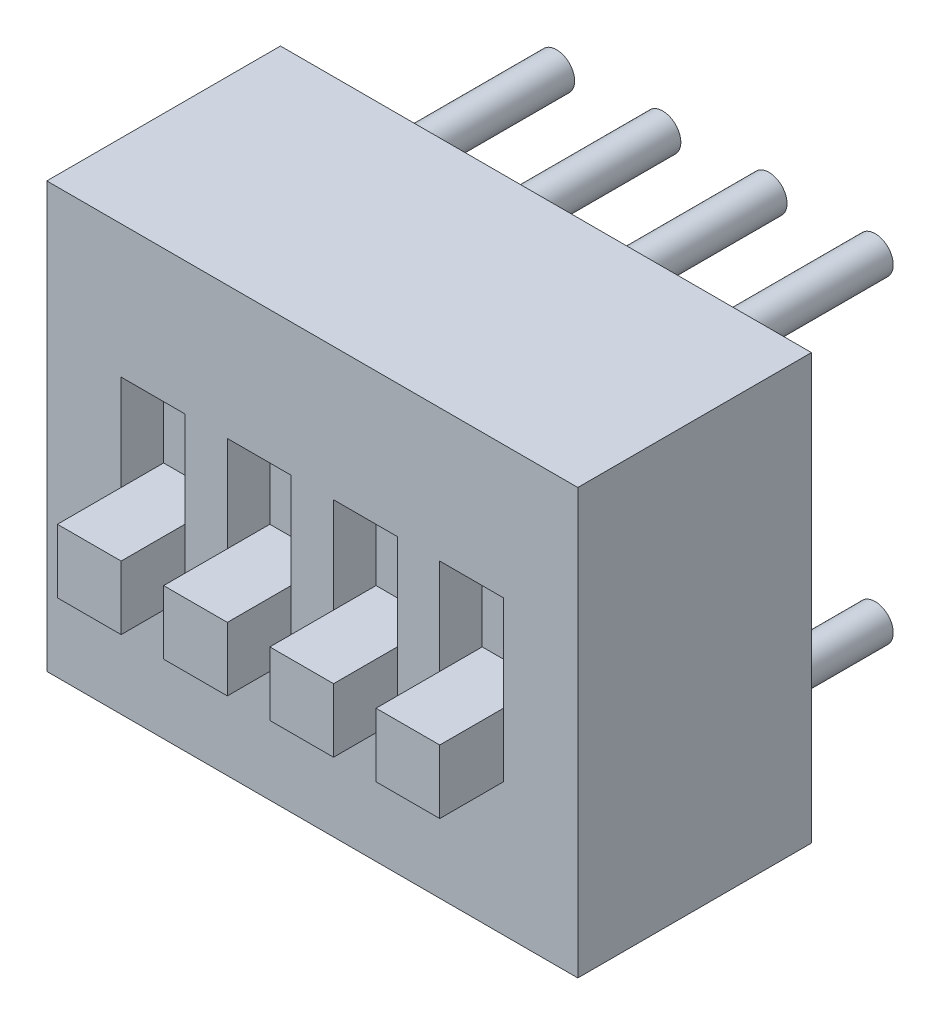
ISO-10303-21;
HEADER;
FILE_DESCRIPTION(('STEP AP214'),'2;1');
FILE_NAME('part.step','',(''),(''),'','','');
FILE_SCHEMA(('AUTOMOTIVE_DESIGN { 1 0 10303 214 1 1 1 1 }'));
ENDSEC;
DATA;
#1=APPLICATION_CONTEXT('core data for automotive mechanical design processes');
#2=APPLICATION_PROTOCOL_DEFINITION('international standard','automotive_design',2000,#1);
#3=PRODUCT_CONTEXT('',#1,'mechanical');
#4=PRODUCT('Part','Part','',(#3));
#5=PRODUCT_RELATED_PRODUCT_CATEGORY('part','',(#4));
#6=PRODUCT_DEFINITION_FORMATION('','',#4);
#7=PRODUCT_DEFINITION_CONTEXT('part definition',#1,'design');
#8=PRODUCT_DEFINITION('design','',#6,#7);
#9=PRODUCT_DEFINITION_SHAPE('','',#8);
#10=(LENGTH_UNIT() NAMED_UNIT(*) SI_UNIT(.MILLI.,.METRE.));
#11=(NAMED_UNIT(*) PLANE_ANGLE_UNIT() SI_UNIT($,.RADIAN.));
#12=(NAMED_UNIT(*) SI_UNIT($,.STERADIAN.) SOLID_ANGLE_UNIT());
#13=UNCERTAINTY_MEASURE_WITH_UNIT(LENGTH_MEASURE(1.E-05),#10,'distance_accuracy_value','');
#14=(GEOMETRIC_REPRESENTATION_CONTEXT(3) GLOBAL_UNCERTAINTY_ASSIGNED_CONTEXT((#13)) GLOBAL_UNIT_ASSIGNED_CONTEXT((#10,
#11,#12)) REPRESENTATION_CONTEXT('',''));
#15=CARTESIAN_POINT('',(0.,0.,0.));
#16=DIRECTION('',(0.,0.,1.));
#17=DIRECTION('',(1.,0.,0.));
#18=AXIS2_PLACEMENT_3D('',#15,#16,#17);
#19=CARTESIAN_POINT('',(7.62,3.81,-4.064));
#20=DIRECTION('',(0.,0.,1.));
#21=DIRECTION('',(1.,0.,0.));
#22=AXIS2_PLACEMENT_3D('',#19,#20,#21);
#23=CYLINDRICAL_SURFACE('',#22,0.4318);
#24=CARTESIAN_POINT('',(7.62,3.81,-4.064));
#25=DIRECTION('',(0.,0.,-1.));
#26=DIRECTION('',(-1.,0.,0.));
#27=AXIS2_PLACEMENT_3D('',#24,#25,#26);
#28=CIRCLE('',#27,0.4318);
#29=CARTESIAN_POINT('',(7.1882,3.81,-4.064));
#30=VERTEX_POINT('',#29);
#31=EDGE_CURVE('E11',#30,#30,#28,.T.);
#32=ORIENTED_EDGE('',*,*,#31,.F.);
#33=EDGE_LOOP('',(#32));
#34=FACE_BOUND('',#33,.T.);
#35=CARTESIAN_POINT('',(7.62,3.81,0.));
#36=DIRECTION('',(0.,0.,-1.));
#37=DIRECTION('',(-1.,0.,0.));
#38=AXIS2_PLACEMENT_3D('',#35,#36,#37);
#39=CIRCLE('',#38,0.4318);
#40=CARTESIAN_POINT('',(7.1882,3.81,0.));
#41=VERTEX_POINT('',#40);
#42=EDGE_CURVE('E43',#41,#41,#39,.T.);
#43=ORIENTED_EDGE('',*,*,#42,.T.);
#44=EDGE_LOOP('',(#43));
#45=FACE_BOUND('',#44,.T.);
#46=ADVANCED_FACE('F40',(#34,#45),#23,.T.);
#47=CARTESIAN_POINT('',(7.62,3.81,-4.064));
#48=DIRECTION('',(0.,0.,-1.));
#49=DIRECTION('',(-1.,0.,0.));
#50=AXIS2_PLACEMENT_3D('',#47,#48,#49);
#51=PLANE('',#50);
#52=ORIENTED_EDGE('',*,*,#31,.T.);
#53=EDGE_LOOP('',(#52));
#54=FACE_BOUND('',#53,.T.);
#55=ADVANCED_FACE('F55',(#54),#51,.T.);
#56=CARTESIAN_POINT('',(7.62,3.81,0.));
#57=DIRECTION('',(0.,0.,-1.));
#58=DIRECTION('',(-1.,0.,0.));
#59=AXIS2_PLACEMENT_3D('',#56,#57,#58);
#60=PLANE('',#59);
#61=ORIENTED_EDGE('',*,*,#42,.F.);
#62=EDGE_LOOP('',(#61));
#63=FACE_BOUND('',#62,.T.);
#64=ADVANCED_FACE('F53',(#63),#60,.F.);
#65=CLOSED_SHELL('',(#46,#55,#64));
#66=MANIFOLD_SOLID_BREP('B2',#65);
#67=CARTESIAN_POINT('',(5.08,3.81,-4.064));
#68=DIRECTION('',(0.,0.,1.));
#69=DIRECTION('',(1.,0.,0.));
#70=AXIS2_PLACEMENT_3D('',#67,#68,#69);
#71=CYLINDRICAL_SURFACE('',#70,0.4318);
#72=CARTESIAN_POINT('',(5.08,3.81,-4.064));
#73=DIRECTION('',(0.,0.,-1.));
#74=DIRECTION('',(-1.,0.,0.));
#75=AXIS2_PLACEMENT_3D('',#72,#73,#74);
#76=CIRCLE('',#75,0.4318);
#77=CARTESIAN_POINT('',(4.6482,3.81,-4.064));
#78=VERTEX_POINT('',#77);
#79=EDGE_CURVE('E39',#78,#78,#76,.T.);
#80=ORIENTED_EDGE('',*,*,#79,.F.);
#81=EDGE_LOOP('',(#80));
#82=FACE_BOUND('',#81,.T.);
#83=CARTESIAN_POINT('',(5.08,3.81,0.));
#84=DIRECTION('',(0.,0.,-1.));
#85=DIRECTION('',(-1.,0.,0.));
#86=AXIS2_PLACEMENT_3D('',#83,#84,#85);
#87=CIRCLE('',#86,0.4318);
#88=CARTESIAN_POINT('',(4.6482,3.81,0.));
#89=VERTEX_POINT('',#88);
#90=EDGE_CURVE('E92',#89,#89,#87,.T.);
#91=ORIENTED_EDGE('',*,*,#90,.T.);
#92=EDGE_LOOP('',(#91));
#93=FACE_BOUND('',#92,.T.);
#94=ADVANCED_FACE('F89',(#82,#93),#71,.T.);
#95=CARTESIAN_POINT('',(5.08,3.81,-4.064));
#96=DIRECTION('',(0.,0.,-1.));
#97=DIRECTION('',(-1.,0.,0.));
#98=AXIS2_PLACEMENT_3D('',#95,#96,#97);
#99=PLANE('',#98);
#100=ORIENTED_EDGE('',*,*,#79,.T.);
#101=EDGE_LOOP('',(#100));
#102=FACE_BOUND('',#101,.T.);
#103=ADVANCED_FACE('F104',(#102),#99,.T.);
#104=CARTESIAN_POINT('',(5.08,3.81,0.));
#105=DIRECTION('',(0.,0.,-1.));
#106=DIRECTION('',(-1.,0.,0.));
#107=AXIS2_PLACEMENT_3D('',#104,#105,#106);
#108=PLANE('',#107);
#109=ORIENTED_EDGE('',*,*,#90,.F.);
#110=EDGE_LOOP('',(#109));
#111=FACE_BOUND('',#110,.T.);
#112=ADVANCED_FACE('F102',(#111),#108,.F.);
#113=CLOSED_SHELL('',(#94,#103,#112));
#114=MANIFOLD_SOLID_BREP('B6',#113);
#115=CARTESIAN_POINT('',(2.54,3.81,-4.064));
#116=DIRECTION('',(0.,0.,1.));
#117=DIRECTION('',(1.,0.,0.));
#118=AXIS2_PLACEMENT_3D('',#115,#116,#117);
#119=CYLINDRICAL_SURFACE('',#118,0.4318);
#120=CARTESIAN_POINT('',(2.54,3.81,-4.064));
#121=DIRECTION('',(0.,0.,-1.));
#122=DIRECTION('',(-1.,0.,0.));
#123=AXIS2_PLACEMENT_3D('',#120,#121,#122);
#124=CIRCLE('',#123,0.4318);
#125=CARTESIAN_POINT('',(2.1082,3.81,-4.064));
#126=VERTEX_POINT('',#125);
#127=EDGE_CURVE('E88',#126,#126,#124,.T.);
#128=ORIENTED_EDGE('',*,*,#127,.F.);
#129=EDGE_LOOP('',(#128));
#130=FACE_BOUND('',#129,.T.);
#131=CARTESIAN_POINT('',(2.54,3.81,0.));
#132=DIRECTION('',(0.,0.,-1.));
#133=DIRECTION('',(-1.,0.,0.));
#134=AXIS2_PLACEMENT_3D('',#131,#132,#133);
#135=CIRCLE('',#134,0.4318);
#136=CARTESIAN_POINT('',(2.1082,3.81,0.));
#137=VERTEX_POINT('',#136);
#138=EDGE_CURVE('E141',#137,#137,#135,.T.);
#139=ORIENTED_EDGE('',*,*,#138,.T.);
#140=EDGE_LOOP('',(#139));
#141=FACE_BOUND('',#140,.T.);
#142=ADVANCED_FACE('F138',(#130,#141),#119,.T.);
#143=CARTESIAN_POINT('',(2.54,3.81,-4.064));
#144=DIRECTION('',(0.,0.,-1.));
#145=DIRECTION('',(-1.,0.,0.));
#146=AXIS2_PLACEMENT_3D('',#143,#144,#145);
#147=PLANE('',#146);
#148=ORIENTED_EDGE('',*,*,#127,.T.);
#149=EDGE_LOOP('',(#148));
#150=FACE_BOUND('',#149,.T.);
#151=ADVANCED_FACE('F153',(#150),#147,.T.);
#152=CARTESIAN_POINT('',(2.54,3.81,0.));
#153=DIRECTION('',(0.,0.,-1.));
#154=DIRECTION('',(-1.,0.,0.));
#155=AXIS2_PLACEMENT_3D('',#152,#153,#154);
#156=PLANE('',#155);
#157=ORIENTED_EDGE('',*,*,#138,.F.);
#158=EDGE_LOOP('',(#157));
#159=FACE_BOUND('',#158,.T.);
#160=ADVANCED_FACE('F151',(#159),#156,.F.);
#161=CLOSED_SHELL('',(#142,#151,#160));
#162=MANIFOLD_SOLID_BREP('B34',#161);
#163=CARTESIAN_POINT('',(7.62,-3.81,-4.064));
#164=DIRECTION('',(0.,0.,1.));
#165=DIRECTION('',(1.,0.,0.));
#166=AXIS2_PLACEMENT_3D('',#163,#164,#165);
#167=CYLINDRICAL_SURFACE('',#166,0.4318);
#168=CARTESIAN_POINT('',(7.62,-3.81,-4.064));
#169=DIRECTION('',(0.,0.,-1.));
#170=DIRECTION('',(-1.,0.,0.));
#171=AXIS2_PLACEMENT_3D('',#168,#169,#170);
#172=CIRCLE('',#171,0.4318);
#173=CARTESIAN_POINT('',(7.1882,-3.81,-4.064));
#174=VERTEX_POINT('',#173);
#175=EDGE_CURVE('E137',#174,#174,#172,.T.);
#176=ORIENTED_EDGE('',*,*,#175,.F.);
#177=EDGE_LOOP('',(#176));
#178=FACE_BOUND('',#177,.T.);
#179=CARTESIAN_POINT('',(7.62,-3.81,0.));
#180=DIRECTION('',(0.,0.,-1.));
#181=DIRECTION('',(-1.,0.,0.));
#182=AXIS2_PLACEMENT_3D('',#179,#180,#181);
#183=CIRCLE('',#182,0.4318);
#184=CARTESIAN_POINT('',(7.1882,-3.81,0.));
#185=VERTEX_POINT('',#184);
#186=EDGE_CURVE('E190',#185,#185,#183,.T.);
#187=ORIENTED_EDGE('',*,*,#186,.T.);
#188=EDGE_LOOP('',(#187));
#189=FACE_BOUND('',#188,.T.);
#190=ADVANCED_FACE('F187',(#178,#189),#167,.T.);
#191=CARTESIAN_POINT('',(7.62,-3.81,-4.064));
#192=DIRECTION('',(0.,0.,-1.));
#193=DIRECTION('',(-1.,0.,0.));
#194=AXIS2_PLACEMENT_3D('',#191,#192,#193);
#195=PLANE('',#194);
#196=ORIENTED_EDGE('',*,*,#175,.T.);
#197=EDGE_LOOP('',(#196));
#198=FACE_BOUND('',#197,.T.);
#199=ADVANCED_FACE('F202',(#198),#195,.T.);
#200=CARTESIAN_POINT('',(7.62,-3.81,0.));
#201=DIRECTION('',(0.,0.,-1.));
#202=DIRECTION('',(-1.,0.,0.));
#203=AXIS2_PLACEMENT_3D('',#200,#201,#202);
#204=PLANE('',#203);
#205=ORIENTED_EDGE('',*,*,#186,.F.);
#206=EDGE_LOOP('',(#205));
#207=FACE_BOUND('',#206,.T.);
#208=ADVANCED_FACE('F200',(#207),#204,.F.);
#209=CLOSED_SHELL('',(#190,#199,#208));
#210=MANIFOLD_SOLID_BREP('B83',#209);
#211=CARTESIAN_POINT('',(5.08,-3.81,-4.064));
#212=DIRECTION('',(0.,0.,1.));
#213=DIRECTION('',(1.,0.,0.));
#214=AXIS2_PLACEMENT_3D('',#211,#212,#213);
#215=CYLINDRICAL_SURFACE('',#214,0.4318);
#216=CARTESIAN_POINT('',(5.08,-3.81,-4.064));
#217=DIRECTION('',(0.,0.,-1.));
#218=DIRECTION('',(-1.,0.,0.));
#219=AXIS2_PLACEMENT_3D('',#216,#217,#218);
#220=CIRCLE('',#219,0.4318);
#221=CARTESIAN_POINT('',(4.6482,-3.81,-4.064));
#222=VERTEX_POINT('',#221);
#223=EDGE_CURVE('E186',#222,#222,#220,.T.);
#224=ORIENTED_EDGE('',*,*,#223,.F.);
#225=EDGE_LOOP('',(#224));
#226=FACE_BOUND('',#225,.T.);
#227=CARTESIAN_POINT('',(5.08,-3.81,0.));
#228=DIRECTION('',(0.,0.,-1.));
#229=DIRECTION('',(-1.,0.,0.));
#230=AXIS2_PLACEMENT_3D('',#227,#228,#229);
#231=CIRCLE('',#230,0.4318);
#232=CARTESIAN_POINT('',(4.6482,-3.81,0.));
#233=VERTEX_POINT('',#232);
#234=EDGE_CURVE('E239',#233,#233,#231,.T.);
#235=ORIENTED_EDGE('',*,*,#234,.T.);
#236=EDGE_LOOP('',(#235));
#237=FACE_BOUND('',#236,.T.);
#238=ADVANCED_FACE('F236',(#226,#237),#215,.T.);
#239=CARTESIAN_POINT('',(5.08,-3.81,-4.064));
#240=DIRECTION('',(0.,0.,-1.));
#241=DIRECTION('',(-1.,0.,0.));
#242=AXIS2_PLACEMENT_3D('',#239,#240,#241);
#243=PLANE('',#242);
#244=ORIENTED_EDGE('',*,*,#223,.T.);
#245=EDGE_LOOP('',(#244));
#246=FACE_BOUND('',#245,.T.);
#247=ADVANCED_FACE('F251',(#246),#243,.T.);
#248=CARTESIAN_POINT('',(5.08,-3.81,0.));
#249=DIRECTION('',(0.,0.,-1.));
#250=DIRECTION('',(-1.,0.,0.));
#251=AXIS2_PLACEMENT_3D('',#248,#249,#250);
#252=PLANE('',#251);
#253=ORIENTED_EDGE('',*,*,#234,.F.);
#254=EDGE_LOOP('',(#253));
#255=FACE_BOUND('',#254,.T.);
#256=ADVANCED_FACE('F249',(#255),#252,.F.);
#257=CLOSED_SHELL('',(#238,#247,#256));
#258=MANIFOLD_SOLID_BREP('B132',#257);
#259=CARTESIAN_POINT('',(2.54,-3.81,-4.064));
#260=DIRECTION('',(0.,0.,1.));
#261=DIRECTION('',(1.,0.,0.));
#262=AXIS2_PLACEMENT_3D('',#259,#260,#261);
#263=CYLINDRICAL_SURFACE('',#262,0.4318);
#264=CARTESIAN_POINT('',(2.54,-3.81,-4.064));
#265=DIRECTION('',(0.,0.,-1.));
#266=DIRECTION('',(-1.,0.,0.));
#267=AXIS2_PLACEMENT_3D('',#264,#265,#266);
#268=CIRCLE('',#267,0.4318);
#269=CARTESIAN_POINT('',(2.1082,-3.81,-4.064));
#270=VERTEX_POINT('',#269);
#271=EDGE_CURVE('E235',#270,#270,#268,.T.);
#272=ORIENTED_EDGE('',*,*,#271,.F.);
#273=EDGE_LOOP('',(#272));
#274=FACE_BOUND('',#273,.T.);
#275=CARTESIAN_POINT('',(2.54,-3.81,0.));
#276=DIRECTION('',(0.,0.,-1.));
#277=DIRECTION('',(-1.,0.,0.));
#278=AXIS2_PLACEMENT_3D('',#275,#276,#277);
#279=CIRCLE('',#278,0.4318);
#280=CARTESIAN_POINT('',(2.1082,-3.81,0.));
#281=VERTEX_POINT('',#280);
#282=EDGE_CURVE('E288',#281,#281,#279,.T.);
#283=ORIENTED_EDGE('',*,*,#282,.T.);
#284=EDGE_LOOP('',(#283));
#285=FACE_BOUND('',#284,.T.);
#286=ADVANCED_FACE('F285',(#274,#285),#263,.T.);
#287=CARTESIAN_POINT('',(2.54,-3.81,-4.064));
#288=DIRECTION('',(0.,0.,-1.));
#289=DIRECTION('',(-1.,0.,0.));
#290=AXIS2_PLACEMENT_3D('',#287,#288,#289);
#291=PLANE('',#290);
#292=ORIENTED_EDGE('',*,*,#271,.T.);
#293=EDGE_LOOP('',(#292));
#294=FACE_BOUND('',#293,.T.);
#295=ADVANCED_FACE('F300',(#294),#291,.T.);
#296=CARTESIAN_POINT('',(2.54,-3.81,0.));
#297=DIRECTION('',(0.,0.,-1.));
#298=DIRECTION('',(-1.,0.,0.));
#299=AXIS2_PLACEMENT_3D('',#296,#297,#298);
#300=PLANE('',#299);
#301=ORIENTED_EDGE('',*,*,#282,.F.);
#302=EDGE_LOOP('',(#301));
#303=FACE_BOUND('',#302,.T.);
#304=ADVANCED_FACE('F298',(#303),#300,.F.);
#305=CLOSED_SHELL('',(#286,#295,#304));
#306=MANIFOLD_SOLID_BREP('B181',#305);
#307=CARTESIAN_POINT('',(0.,-3.81,-4.064));
#308=DIRECTION('',(0.,0.,1.));
#309=DIRECTION('',(1.,0.,0.));
#310=AXIS2_PLACEMENT_3D('',#307,#308,#309);
#311=CYLINDRICAL_SURFACE('',#310,0.4318);
#312=CARTESIAN_POINT('',(0.,-3.81,-4.064));
#313=DIRECTION('',(0.,0.,-1.));
#314=DIRECTION('',(-1.,0.,0.));
#315=AXIS2_PLACEMENT_3D('',#312,#313,#314);
#316=CIRCLE('',#315,0.4318);
#317=CARTESIAN_POINT('',(-0.4318,-3.81,-4.064));
#318=VERTEX_POINT('',#317);
#319=EDGE_CURVE('E284',#318,#318,#316,.T.);
#320=ORIENTED_EDGE('',*,*,#319,.F.);
#321=EDGE_LOOP('',(#320));
#322=FACE_BOUND('',#321,.T.);
#323=CARTESIAN_POINT('',(0.,-3.81,0.));
#324=DIRECTION('',(0.,0.,-1.));
#325=DIRECTION('',(-1.,0.,0.));
#326=AXIS2_PLACEMENT_3D('',#323,#324,#325);
#327=CIRCLE('',#326,0.4318);
#328=CARTESIAN_POINT('',(-0.4318,-3.81,0.));
#329=VERTEX_POINT('',#328);
#330=EDGE_CURVE('E337',#329,#329,#327,.T.);
#331=ORIENTED_EDGE('',*,*,#330,.T.);
#332=EDGE_LOOP('',(#331));
#333=FACE_BOUND('',#332,.T.);
#334=ADVANCED_FACE('F334',(#322,#333),#311,.T.);
#335=CARTESIAN_POINT('',(0.,-3.81,-4.064));
#336=DIRECTION('',(0.,0.,-1.));
#337=DIRECTION('',(-1.,0.,0.));
#338=AXIS2_PLACEMENT_3D('',#335,#336,#337);
#339=PLANE('',#338);
#340=ORIENTED_EDGE('',*,*,#319,.T.);
#341=EDGE_LOOP('',(#340));
#342=FACE_BOUND('',#341,.T.);
#343=ADVANCED_FACE('F349',(#342),#339,.T.);
#344=CARTESIAN_POINT('',(0.,-3.81,0.));
#345=DIRECTION('',(0.,0.,-1.));
#346=DIRECTION('',(-1.,0.,0.));
#347=AXIS2_PLACEMENT_3D('',#344,#345,#346);
#348=PLANE('',#347);
#349=ORIENTED_EDGE('',*,*,#330,.F.);
#350=EDGE_LOOP('',(#349));
#351=FACE_BOUND('',#350,.T.);
#352=ADVANCED_FACE('F347',(#351),#348,.F.);
#353=CLOSED_SHELL('',(#334,#343,#352));
#354=MANIFOLD_SOLID_BREP('B230',#353);
#355=CARTESIAN_POINT('',(0.,3.81,-4.064));
#356=DIRECTION('',(0.,0.,1.));
#357=DIRECTION('',(1.,0.,0.));
#358=AXIS2_PLACEMENT_3D('',#355,#356,#357);
#359=CYLINDRICAL_SURFACE('',#358,0.4318);
#360=CARTESIAN_POINT('',(0.,3.81,-4.064));
#361=DIRECTION('',(0.,0.,-1.));
#362=DIRECTION('',(-1.,0.,0.));
#363=AXIS2_PLACEMENT_3D('',#360,#361,#362);
#364=CIRCLE('',#363,0.4318);
#365=CARTESIAN_POINT('',(-0.4318,3.81,-4.064));
#366=VERTEX_POINT('',#365);
#367=EDGE_CURVE('E333',#366,#366,#364,.T.);
#368=ORIENTED_EDGE('',*,*,#367,.F.);
#369=EDGE_LOOP('',(#368));
#370=FACE_BOUND('',#369,.T.);
#371=CARTESIAN_POINT('',(0.,3.81,0.));
#372=DIRECTION('',(0.,0.,-1.));
#373=DIRECTION('',(-1.,0.,0.));
#374=AXIS2_PLACEMENT_3D('',#371,#372,#373);
#375=CIRCLE('',#374,0.4318);
#376=CARTESIAN_POINT('',(-0.4318,3.81,0.));
#377=VERTEX_POINT('',#376);
#378=EDGE_CURVE('E388',#377,#377,#375,.T.);
#379=ORIENTED_EDGE('',*,*,#378,.T.);
#380=EDGE_LOOP('',(#379));
#381=FACE_BOUND('',#380,.T.);
#382=ADVANCED_FACE('F385',(#370,#381),#359,.T.);
#383=CARTESIAN_POINT('',(0.,3.81,-4.064));
#384=DIRECTION('',(0.,0.,-1.));
#385=DIRECTION('',(-1.,0.,0.));
#386=AXIS2_PLACEMENT_3D('',#383,#384,#385);
#387=PLANE('',#386);
#388=ORIENTED_EDGE('',*,*,#367,.T.);
#389=EDGE_LOOP('',(#388));
#390=FACE_BOUND('',#389,.T.);
#391=ADVANCED_FACE('F400',(#390),#387,.T.);
#392=CARTESIAN_POINT('',(0.,3.81,0.));
#393=DIRECTION('',(0.,0.,-1.));
#394=DIRECTION('',(-1.,0.,0.));
#395=AXIS2_PLACEMENT_3D('',#392,#393,#394);
#396=PLANE('',#395);
#397=ORIENTED_EDGE('',*,*,#378,.F.);
#398=EDGE_LOOP('',(#397));
#399=FACE_BOUND('',#398,.T.);
#400=ADVANCED_FACE('F398',(#399),#396,.F.);
#401=CLOSED_SHELL('',(#382,#391,#400));
#402=MANIFOLD_SOLID_BREP('B279',#401);
#403=CARTESIAN_POINT('',(6.858,-0.381000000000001,7.112));
#404=DIRECTION('',(1.,0.,0.));
#405=DIRECTION('',(0.,1.,0.));
#406=AXIS2_PLACEMENT_3D('',#403,#404,#405);
#407=PLANE('',#406);
#408=DIRECTION('',(0.,-1.,0.));
#409=VECTOR('',#408,1.);
#410=CARTESIAN_POINT('',(6.858,-0.381000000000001,4.572));
#411=LINE('',#410,#409);
#412=CARTESIAN_POINT('',(6.858,-0.381000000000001,4.572));
#413=VERTEX_POINT('',#412);
#414=CARTESIAN_POINT('',(6.858,-1.905,4.572));
#415=VERTEX_POINT('',#414);
#416=EDGE_CURVE('E499',#413,#415,#411,.T.);
#417=ORIENTED_EDGE('',*,*,#416,.T.);
#418=DIRECTION('',(0.,0.,-1.));
#419=VECTOR('',#418,1.);
#420=CARTESIAN_POINT('',(6.858,-1.905,7.112));
#421=LINE('',#420,#419);
#422=CARTESIAN_POINT('',(6.858,-1.905,7.112));
#423=VERTEX_POINT('',#422);
#424=EDGE_CURVE('E383',#423,#415,#421,.T.);
#425=ORIENTED_EDGE('',*,*,#424,.F.);
#426=DIRECTION('',(0.,-1.,0.));
#427=VECTOR('',#426,1.);
#428=CARTESIAN_POINT('',(6.858,-0.381000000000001,7.112));
#429=LINE('',#428,#427);
#430=CARTESIAN_POINT('',(6.858,-0.381000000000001,7.112));
#431=VERTEX_POINT('',#430);
#432=EDGE_CURVE('E487',#431,#423,#429,.T.);
#433=ORIENTED_EDGE('',*,*,#432,.F.);
#434=DIRECTION('',(0.,0.,-1.));
#435=VECTOR('',#434,1.);
#436=CARTESIAN_POINT('',(6.858,-0.381000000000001,7.112));
#437=LINE('',#436,#435);
#438=EDGE_CURVE('E495',#431,#413,#437,.T.);
#439=ORIENTED_EDGE('',*,*,#438,.T.);
#440=EDGE_LOOP('',(#417,#425,#433,#439));
#441=FACE_BOUND('',#440,.T.);
#442=ADVANCED_FACE('F436',(#441),#407,.F.);
#443=CARTESIAN_POINT('',(6.858,-1.905,7.112));
#444=DIRECTION('',(0.,1.,0.));
#445=DIRECTION('',(0.,0.,1.));
#446=AXIS2_PLACEMENT_3D('',#443,#444,#445);
#447=PLANE('',#446);
#448=DIRECTION('',(1.,0.,0.));
#449=VECTOR('',#448,1.);
#450=CARTESIAN_POINT('',(6.858,-1.905,4.572));
#451=LINE('',#450,#449);
#452=CARTESIAN_POINT('',(8.382,-1.905,4.572));
#453=VERTEX_POINT('',#452);
#454=EDGE_CURVE('E491',#415,#453,#451,.T.);
#455=ORIENTED_EDGE('',*,*,#454,.T.);
#456=DIRECTION('',(0.,0.,-1.));
#457=VECTOR('',#456,1.);
#458=CARTESIAN_POINT('',(8.382,-1.905,7.112));
#459=LINE('',#458,#457);
#460=CARTESIAN_POINT('',(8.382,-1.905,7.112));
#461=VERTEX_POINT('',#460);
#462=EDGE_CURVE('E444',#461,#453,#459,.T.);
#463=ORIENTED_EDGE('',*,*,#462,.F.);
#464=DIRECTION('',(1.,0.,0.));
#465=VECTOR('',#464,1.);
#466=CARTESIAN_POINT('',(6.858,-1.905,7.112));
#467=LINE('',#466,#465);
#468=EDGE_CURVE('E482',#423,#461,#467,.T.);
#469=ORIENTED_EDGE('',*,*,#468,.F.);
#470=ORIENTED_EDGE('',*,*,#424,.T.);
#471=EDGE_LOOP('',(#455,#463,#469,#470));
#472=FACE_BOUND('',#471,.T.);
#473=ADVANCED_FACE('F490',(#472),#447,.F.);
#474=CARTESIAN_POINT('',(8.382,-0.381,7.112));
#475=DIRECTION('',(-1.,0.,0.));
#476=DIRECTION('',(0.,-1.,0.));
#477=AXIS2_PLACEMENT_3D('',#474,#475,#476);
#478=PLANE('',#477);
#479=DIRECTION('',(0.,1.,0.));
#480=VECTOR('',#479,1.);
#481=CARTESIAN_POINT('',(8.382,-0.381,4.572));
#482=LINE('',#481,#480);
#483=CARTESIAN_POINT('',(8.382,-0.381,4.572));
#484=VERTEX_POINT('',#483);
#485=EDGE_CURVE('E469',#453,#484,#482,.T.);
#486=ORIENTED_EDGE('',*,*,#485,.T.);
#487=DIRECTION('',(0.,0.,-1.));
#488=VECTOR('',#487,1.);
#489=CARTESIAN_POINT('',(8.382,-0.381,7.112));
#490=LINE('',#489,#488);
#491=CARTESIAN_POINT('',(8.382,-0.381,7.112));
#492=VERTEX_POINT('',#491);
#493=EDGE_CURVE('E492',#492,#484,#490,.T.);
#494=ORIENTED_EDGE('',*,*,#493,.F.);
#495=DIRECTION('',(0.,1.,0.));
#496=VECTOR('',#495,1.);
#497=CARTESIAN_POINT('',(8.382,-0.381,7.112));
#498=LINE('',#497,#496);
#499=EDGE_CURVE('E485',#461,#492,#498,.T.);
#500=ORIENTED_EDGE('',*,*,#499,.F.);
#501=ORIENTED_EDGE('',*,*,#462,.T.);
#502=EDGE_LOOP('',(#486,#494,#500,#501));
#503=FACE_BOUND('',#502,.T.);
#504=ADVANCED_FACE('F493',(#503),#478,.F.);
#505=CARTESIAN_POINT('',(6.858,-0.381000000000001,7.112));
#506=DIRECTION('',(0.,-1.,0.));
#507=DIRECTION('',(1.,0.,0.));
#508=AXIS2_PLACEMENT_3D('',#505,#506,#507);
#509=PLANE('',#508);
#510=DIRECTION('',(-1.,0.,0.));
#511=VECTOR('',#510,1.);
#512=CARTESIAN_POINT('',(6.858,-0.381000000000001,4.572));
#513=LINE('',#512,#511);
#514=EDGE_CURVE('E475',#484,#413,#513,.T.);
#515=ORIENTED_EDGE('',*,*,#514,.T.);
#516=ORIENTED_EDGE('',*,*,#438,.F.);
#517=DIRECTION('',(-1.,0.,0.));
#518=VECTOR('',#517,1.);
#519=CARTESIAN_POINT('',(6.858,-0.381000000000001,7.112));
#520=LINE('',#519,#518);
#521=EDGE_CURVE('E452',#492,#431,#520,.T.);
#522=ORIENTED_EDGE('',*,*,#521,.F.);
#523=ORIENTED_EDGE('',*,*,#493,.T.);
#524=EDGE_LOOP('',(#515,#516,#522,#523));
#525=FACE_BOUND('',#524,.T.);
#526=ADVANCED_FACE('F506',(#525),#509,.F.);
#527=CARTESIAN_POINT('',(6.858,-1.905,7.112));
#528=DIRECTION('',(0.,0.,1.));
#529=DIRECTION('',(1.,0.,0.));
#530=AXIS2_PLACEMENT_3D('',#527,#528,#529);
#531=PLANE('',#530);
#532=ORIENTED_EDGE('',*,*,#432,.T.);
#533=ORIENTED_EDGE('',*,*,#468,.T.);
#534=ORIENTED_EDGE('',*,*,#499,.T.);
#535=ORIENTED_EDGE('',*,*,#521,.T.);
#536=EDGE_LOOP('',(#532,#533,#534,#535));
#537=FACE_BOUND('',#536,.T.);
#538=ADVANCED_FACE('F483',(#537),#531,.T.);
#539=CARTESIAN_POINT('',(6.858,-1.905,4.572));
#540=DIRECTION('',(0.,0.,1.));
#541=DIRECTION('',(1.,0.,0.));
#542=AXIS2_PLACEMENT_3D('',#539,#540,#541);
#543=PLANE('',#542);
#544=ORIENTED_EDGE('',*,*,#416,.F.);
#545=ORIENTED_EDGE('',*,*,#514,.F.);
#546=ORIENTED_EDGE('',*,*,#485,.F.);
#547=ORIENTED_EDGE('',*,*,#454,.F.);
#548=EDGE_LOOP('',(#544,#545,#546,#547));
#549=FACE_BOUND('',#548,.T.);
#550=ADVANCED_FACE('F509',(#549),#543,.F.);
#551=CLOSED_SHELL('',(#442,#473,#504,#526,#538,#550));
#552=MANIFOLD_SOLID_BREP('B328',#551);
#553=CARTESIAN_POINT('',(4.318,-0.381,7.112));
#554=DIRECTION('',(1.,0.,0.));
#555=DIRECTION('',(0.,0.,-1.));
#556=AXIS2_PLACEMENT_3D('',#553,#554,#555);
#557=PLANE('',#556);
#558=DIRECTION('',(0.,-1.,0.));
#559=VECTOR('',#558,1.);
#560=CARTESIAN_POINT('',(4.318,-0.381,4.572));
#561=LINE('',#560,#559);
#562=CARTESIAN_POINT('',(4.318,-0.381,4.572));
#563=VERTEX_POINT('',#562);
#564=CARTESIAN_POINT('',(4.318,-1.905,4.572));
#565=VERTEX_POINT('',#564);
#566=EDGE_CURVE('E633',#563,#565,#561,.T.);
#567=ORIENTED_EDGE('',*,*,#566,.T.);
#568=DIRECTION('',(0.,0.,-1.));
#569=VECTOR('',#568,1.);
#570=CARTESIAN_POINT('',(4.318,-1.905,7.112));
#571=LINE('',#570,#569);
#572=CARTESIAN_POINT('',(4.318,-1.905,7.112));
#573=VERTEX_POINT('',#572);
#574=EDGE_CURVE('E434',#573,#565,#571,.T.);
#575=ORIENTED_EDGE('',*,*,#574,.F.);
#576=DIRECTION('',(0.,-1.,0.));
#577=VECTOR('',#576,1.);
#578=CARTESIAN_POINT('',(4.318,-0.381,7.112));
#579=LINE('',#578,#577);
#580=CARTESIAN_POINT('',(4.318,-0.381,7.112));
#581=VERTEX_POINT('',#580);
#582=EDGE_CURVE('E621',#581,#573,#579,.T.);
#583=ORIENTED_EDGE('',*,*,#582,.F.);
#584=DIRECTION('',(0.,0.,-1.));
#585=VECTOR('',#584,1.);
#586=CARTESIAN_POINT('',(4.318,-0.381,7.112));
#587=LINE('',#586,#585);
#588=EDGE_CURVE('E629',#581,#563,#587,.T.);
#589=ORIENTED_EDGE('',*,*,#588,.T.);
#590=EDGE_LOOP('',(#567,#575,#583,#589));
#591=FACE_BOUND('',#590,.T.);
#592=ADVANCED_FACE('F570',(#591),#557,.F.);
#593=CARTESIAN_POINT('',(4.318,-1.905,7.112));
#594=DIRECTION('',(0.,1.,0.));
#595=DIRECTION('',(0.,0.,1.));
#596=AXIS2_PLACEMENT_3D('',#593,#594,#595);
#597=PLANE('',#596);
#598=DIRECTION('',(1.,0.,0.));
#599=VECTOR('',#598,1.);
#600=CARTESIAN_POINT('',(4.318,-1.905,4.572));
#601=LINE('',#600,#599);
#602=CARTESIAN_POINT('',(5.842,-1.905,4.572));
#603=VERTEX_POINT('',#602);
#604=EDGE_CURVE('E625',#565,#603,#601,.T.);
#605=ORIENTED_EDGE('',*,*,#604,.T.);
#606=DIRECTION('',(0.,0.,-1.));
#607=VECTOR('',#606,1.);
#608=CARTESIAN_POINT('',(5.842,-1.905,7.112));
#609=LINE('',#608,#607);
#610=CARTESIAN_POINT('',(5.842,-1.905,7.112));
#611=VERTEX_POINT('',#610);
#612=EDGE_CURVE('E578',#611,#603,#609,.T.);
#613=ORIENTED_EDGE('',*,*,#612,.F.);
#614=DIRECTION('',(1.,0.,0.));
#615=VECTOR('',#614,1.);
#616=CARTESIAN_POINT('',(4.318,-1.905,7.112));
#617=LINE('',#616,#615);
#618=EDGE_CURVE('E616',#573,#611,#617,.T.);
#619=ORIENTED_EDGE('',*,*,#618,.F.);
#620=ORIENTED_EDGE('',*,*,#574,.T.);
#621=EDGE_LOOP('',(#605,#613,#619,#620));
#622=FACE_BOUND('',#621,.T.);
#623=ADVANCED_FACE('F624',(#622),#597,.F.);
#624=CARTESIAN_POINT('',(5.842,-0.381,7.112));
#625=DIRECTION('',(-1.,0.,0.));
#626=DIRECTION('',(0.,0.,1.));
#627=AXIS2_PLACEMENT_3D('',#624,#625,#626);
#628=PLANE('',#627);
#629=DIRECTION('',(0.,1.,0.));
#630=VECTOR('',#629,1.);
#631=CARTESIAN_POINT('',(5.842,-0.381,4.572));
#632=LINE('',#631,#630);
#633=CARTESIAN_POINT('',(5.842,-0.381,4.572));
#634=VERTEX_POINT('',#633);
#635=EDGE_CURVE('E603',#603,#634,#632,.T.);
#636=ORIENTED_EDGE('',*,*,#635,.T.);
#637=DIRECTION('',(0.,0.,-1.));
#638=VECTOR('',#637,1.);
#639=CARTESIAN_POINT('',(5.842,-0.381,7.112));
#640=LINE('',#639,#638);
#641=CARTESIAN_POINT('',(5.842,-0.381,7.112));
#642=VERTEX_POINT('',#641);
#643=EDGE_CURVE('E626',#642,#634,#640,.T.);
#644=ORIENTED_EDGE('',*,*,#643,.F.);
#645=DIRECTION('',(0.,1.,0.));
#646=VECTOR('',#645,1.);
#647=CARTESIAN_POINT('',(5.842,-0.381,7.112));
#648=LINE('',#647,#646);
#649=EDGE_CURVE('E619',#611,#642,#648,.T.);
#650=ORIENTED_EDGE('',*,*,#649,.F.);
#651=ORIENTED_EDGE('',*,*,#612,.T.);
#652=EDGE_LOOP('',(#636,#644,#650,#651));
#653=FACE_BOUND('',#652,.T.);
#654=ADVANCED_FACE('F627',(#653),#628,.F.);
#655=CARTESIAN_POINT('',(4.318,-0.381,7.112));
#656=DIRECTION('',(0.,-1.,0.));
#657=DIRECTION('',(0.,0.,-1.));
#658=AXIS2_PLACEMENT_3D('',#655,#656,#657);
#659=PLANE('',#658);
#660=DIRECTION('',(-1.,0.,0.));
#661=VECTOR('',#660,1.);
#662=CARTESIAN_POINT('',(4.318,-0.381,4.572));
#663=LINE('',#662,#661);
#664=EDGE_CURVE('E609',#634,#563,#663,.T.);
#665=ORIENTED_EDGE('',*,*,#664,.T.);
#666=ORIENTED_EDGE('',*,*,#588,.F.);
#667=DIRECTION('',(-1.,0.,0.));
#668=VECTOR('',#667,1.);
#669=CARTESIAN_POINT('',(4.318,-0.381,7.112));
#670=LINE('',#669,#668);
#671=EDGE_CURVE('E586',#642,#581,#670,.T.);
#672=ORIENTED_EDGE('',*,*,#671,.F.);
#673=ORIENTED_EDGE('',*,*,#643,.T.);
#674=EDGE_LOOP('',(#665,#666,#672,#673));
#675=FACE_BOUND('',#674,.T.);
#676=ADVANCED_FACE('F640',(#675),#659,.F.);
#677=CARTESIAN_POINT('',(4.318,-1.905,7.112));
#678=DIRECTION('',(0.,0.,1.));
#679=DIRECTION('',(1.,0.,0.));
#680=AXIS2_PLACEMENT_3D('',#677,#678,#679);
#681=PLANE('',#680);
#682=ORIENTED_EDGE('',*,*,#582,.T.);
#683=ORIENTED_EDGE('',*,*,#618,.T.);
#684=ORIENTED_EDGE('',*,*,#649,.T.);
#685=ORIENTED_EDGE('',*,*,#671,.T.);
#686=EDGE_LOOP('',(#682,#683,#684,#685));
#687=FACE_BOUND('',#686,.T.);
#688=ADVANCED_FACE('F617',(#687),#681,.T.);
#689=CARTESIAN_POINT('',(4.318,-1.905,4.572));
#690=DIRECTION('',(0.,0.,1.));
#691=DIRECTION('',(1.,0.,0.));
#692=AXIS2_PLACEMENT_3D('',#689,#690,#691);
#693=PLANE('',#692);
#694=ORIENTED_EDGE('',*,*,#566,.F.);
#695=ORIENTED_EDGE('',*,*,#664,.F.);
#696=ORIENTED_EDGE('',*,*,#635,.F.);
#697=ORIENTED_EDGE('',*,*,#604,.F.);
#698=EDGE_LOOP('',(#694,#695,#696,#697));
#699=FACE_BOUND('',#698,.T.);
#700=ADVANCED_FACE('F643',(#699),#693,.F.);
#701=CLOSED_SHELL('',(#592,#623,#654,#676,#688,#700));
#702=MANIFOLD_SOLID_BREP('B377',#701);
#703=CARTESIAN_POINT('',(1.778,-0.381,7.112));
#704=DIRECTION('',(1.,0.,0.));
#705=DIRECTION('',(0.,0.,-1.));
#706=AXIS2_PLACEMENT_3D('',#703,#704,#705);
#707=PLANE('',#706);
#708=DIRECTION('',(0.,-1.,0.));
#709=VECTOR('',#708,1.);
#710=CARTESIAN_POINT('',(1.778,-0.381,4.572));
#711=LINE('',#710,#709);
#712=CARTESIAN_POINT('',(1.778,-0.381,4.572));
#713=VERTEX_POINT('',#712);
#714=CARTESIAN_POINT('',(1.778,-1.905,4.572));
#715=VERTEX_POINT('',#714);
#716=EDGE_CURVE('E767',#713,#715,#711,.T.);
#717=ORIENTED_EDGE('',*,*,#716,.T.);
#718=DIRECTION('',(0.,0.,-1.));
#719=VECTOR('',#718,1.);
#720=CARTESIAN_POINT('',(1.778,-1.905,7.112));
#721=LINE('',#720,#719);
#722=CARTESIAN_POINT('',(1.778,-1.905,7.112));
#723=VERTEX_POINT('',#722);
#724=EDGE_CURVE('E568',#723,#715,#721,.T.);
#725=ORIENTED_EDGE('',*,*,#724,.F.);
#726=DIRECTION('',(0.,-1.,0.));
#727=VECTOR('',#726,1.);
#728=CARTESIAN_POINT('',(1.778,-0.381,7.112));
#729=LINE('',#728,#727);
#730=CARTESIAN_POINT('',(1.778,-0.381,7.112));
#731=VERTEX_POINT('',#730);
#732=EDGE_CURVE('E755',#731,#723,#729,.T.);
#733=ORIENTED_EDGE('',*,*,#732,.F.);
#734=DIRECTION('',(0.,0.,-1.));
#735=VECTOR('',#734,1.);
#736=CARTESIAN_POINT('',(1.778,-0.381,7.112));
#737=LINE('',#736,#735);
#738=EDGE_CURVE('E763',#731,#713,#737,.T.);
#739=ORIENTED_EDGE('',*,*,#738,.T.);
#740=EDGE_LOOP('',(#717,#725,#733,#739));
#741=FACE_BOUND('',#740,.T.);
#742=ADVANCED_FACE('F704',(#741),#707,.F.);
#743=CARTESIAN_POINT('',(1.778,-1.905,7.112));
#744=DIRECTION('',(0.,1.,0.));
#745=DIRECTION('',(0.,0.,1.));
#746=AXIS2_PLACEMENT_3D('',#743,#744,#745);
#747=PLANE('',#746);
#748=DIRECTION('',(1.,0.,0.));
#749=VECTOR('',#748,1.);
#750=CARTESIAN_POINT('',(1.778,-1.905,4.572));
#751=LINE('',#750,#749);
#752=CARTESIAN_POINT('',(3.302,-1.905,4.572));
#753=VERTEX_POINT('',#752);
#754=EDGE_CURVE('E759',#715,#753,#751,.T.);
#755=ORIENTED_EDGE('',*,*,#754,.T.);
#756=DIRECTION('',(0.,0.,-1.));
#757=VECTOR('',#756,1.);
#758=CARTESIAN_POINT('',(3.302,-1.905,7.112));
#759=LINE('',#758,#757);
#760=CARTESIAN_POINT('',(3.302,-1.905,7.112));
#761=VERTEX_POINT('',#760);
#762=EDGE_CURVE('E712',#761,#753,#759,.T.);
#763=ORIENTED_EDGE('',*,*,#762,.F.);
#764=DIRECTION('',(1.,0.,0.));
#765=VECTOR('',#764,1.);
#766=CARTESIAN_POINT('',(1.778,-1.905,7.112));
#767=LINE('',#766,#765);
#768=EDGE_CURVE('E750',#723,#761,#767,.T.);
#769=ORIENTED_EDGE('',*,*,#768,.F.);
#770=ORIENTED_EDGE('',*,*,#724,.T.);
#771=EDGE_LOOP('',(#755,#763,#769,#770));
#772=FACE_BOUND('',#771,.T.);
#773=ADVANCED_FACE('F758',(#772),#747,.F.);
#774=CARTESIAN_POINT('',(3.302,-0.381,7.112));
#775=DIRECTION('',(-1.,0.,0.));
#776=DIRECTION('',(0.,0.,1.));
#777=AXIS2_PLACEMENT_3D('',#774,#775,#776);
#778=PLANE('',#777);
#779=DIRECTION('',(0.,1.,0.));
#780=VECTOR('',#779,1.);
#781=CARTESIAN_POINT('',(3.302,-0.381,4.572));
#782=LINE('',#781,#780);
#783=CARTESIAN_POINT('',(3.302,-0.381,4.572));
#784=VERTEX_POINT('',#783);
#785=EDGE_CURVE('E737',#753,#784,#782,.T.);
#786=ORIENTED_EDGE('',*,*,#785,.T.);
#787=DIRECTION('',(0.,0.,-1.));
#788=VECTOR('',#787,1.);
#789=CARTESIAN_POINT('',(3.302,-0.381,7.112));
#790=LINE('',#789,#788);
#791=CARTESIAN_POINT('',(3.302,-0.381,7.112));
#792=VERTEX_POINT('',#791);
#793=EDGE_CURVE('E760',#792,#784,#790,.T.);
#794=ORIENTED_EDGE('',*,*,#793,.F.);
#795=DIRECTION('',(0.,1.,0.));
#796=VECTOR('',#795,1.);
#797=CARTESIAN_POINT('',(3.302,-0.381,7.112));
#798=LINE('',#797,#796);
#799=EDGE_CURVE('E753',#761,#792,#798,.T.);
#800=ORIENTED_EDGE('',*,*,#799,.F.);
#801=ORIENTED_EDGE('',*,*,#762,.T.);
#802=EDGE_LOOP('',(#786,#794,#800,#801));
#803=FACE_BOUND('',#802,.T.);
#804=ADVANCED_FACE('F761',(#803),#778,.F.);
#805=CARTESIAN_POINT('',(1.778,-0.381,7.112));
#806=DIRECTION('',(0.,-1.,0.));
#807=DIRECTION('',(0.,0.,-1.));
#808=AXIS2_PLACEMENT_3D('',#805,#806,#807);
#809=PLANE('',#808);
#810=DIRECTION('',(-1.,0.,0.));
#811=VECTOR('',#810,1.);
#812=CARTESIAN_POINT('',(1.778,-0.381,4.572));
#813=LINE('',#812,#811);
#814=EDGE_CURVE('E743',#784,#713,#813,.T.);
#815=ORIENTED_EDGE('',*,*,#814,.T.);
#816=ORIENTED_EDGE('',*,*,#738,.F.);
#817=DIRECTION('',(-1.,0.,0.));
#818=VECTOR('',#817,1.);
#819=CARTESIAN_POINT('',(1.778,-0.381,7.112));
#820=LINE('',#819,#818);
#821=EDGE_CURVE('E720',#792,#731,#820,.T.);
#822=ORIENTED_EDGE('',*,*,#821,.F.);
#823=ORIENTED_EDGE('',*,*,#793,.T.);
#824=EDGE_LOOP('',(#815,#816,#822,#823));
#825=FACE_BOUND('',#824,.T.);
#826=ADVANCED_FACE('F774',(#825),#809,.F.);
#827=CARTESIAN_POINT('',(1.778,-1.905,7.112));
#828=DIRECTION('',(0.,0.,1.));
#829=DIRECTION('',(1.,0.,0.));
#830=AXIS2_PLACEMENT_3D('',#827,#828,#829);
#831=PLANE('',#830);
#832=ORIENTED_EDGE('',*,*,#732,.T.);
#833=ORIENTED_EDGE('',*,*,#768,.T.);
#834=ORIENTED_EDGE('',*,*,#799,.T.);
#835=ORIENTED_EDGE('',*,*,#821,.T.);
#836=EDGE_LOOP('',(#832,#833,#834,#835));
#837=FACE_BOUND('',#836,.T.);
#838=ADVANCED_FACE('F751',(#837),#831,.T.);
#839=CARTESIAN_POINT('',(1.778,-1.905,4.572));
#840=DIRECTION('',(0.,0.,1.));
#841=DIRECTION('',(1.,0.,0.));
#842=AXIS2_PLACEMENT_3D('',#839,#840,#841);
#843=PLANE('',#842);
#844=ORIENTED_EDGE('',*,*,#716,.F.);
#845=ORIENTED_EDGE('',*,*,#814,.F.);
#846=ORIENTED_EDGE('',*,*,#785,.F.);
#847=ORIENTED_EDGE('',*,*,#754,.F.);
#848=EDGE_LOOP('',(#844,#845,#846,#847));
#849=FACE_BOUND('',#848,.T.);
#850=ADVANCED_FACE('F777',(#849),#843,.F.);
#851=CLOSED_SHELL('',(#742,#773,#804,#826,#838,#850));
#852=MANIFOLD_SOLID_BREP('B428',#851);
#853=CARTESIAN_POINT('',(-0.761999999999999,-1.905,7.112));
#854=DIRECTION('',(1.,0.,0.));
#855=DIRECTION('',(0.,0.,-1.));
#856=AXIS2_PLACEMENT_3D('',#853,#854,#855);
#857=PLANE('',#856);
#858=DIRECTION('',(0.,-1.,0.));
#859=VECTOR('',#858,1.);
#860=CARTESIAN_POINT('',(-0.761999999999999,-1.905,4.572));
#861=LINE('',#860,#859);
#862=CARTESIAN_POINT('',(-0.761999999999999,-0.381,4.572));
#863=VERTEX_POINT('',#862);
#864=CARTESIAN_POINT('',(-0.761999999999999,-1.905,4.572));
#865=VERTEX_POINT('',#864);
#866=EDGE_CURVE('E900',#863,#865,#861,.T.);
#867=ORIENTED_EDGE('',*,*,#866,.T.);
#868=DIRECTION('',(0.,0.,-1.));
#869=VECTOR('',#868,1.);
#870=CARTESIAN_POINT('',(-0.761999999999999,-1.905,7.112));
#871=LINE('',#870,#869);
#872=CARTESIAN_POINT('',(-0.761999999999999,-1.905,7.112));
#873=VERTEX_POINT('',#872);
#874=EDGE_CURVE('E702',#873,#865,#871,.T.);
#875=ORIENTED_EDGE('',*,*,#874,.F.);
#876=DIRECTION('',(0.,-1.,0.));
#877=VECTOR('',#876,1.);
#878=CARTESIAN_POINT('',(-0.761999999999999,-1.905,7.112));
#879=LINE('',#878,#877);
#880=CARTESIAN_POINT('',(-0.761999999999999,-0.381,7.112));
#881=VERTEX_POINT('',#880);
#882=EDGE_CURVE('E888',#881,#873,#879,.T.);
#883=ORIENTED_EDGE('',*,*,#882,.F.);
#884=DIRECTION('',(0.,0.,-1.));
#885=VECTOR('',#884,1.);
#886=CARTESIAN_POINT('',(-0.761999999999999,-0.381,7.112));
#887=LINE('',#886,#885);
#888=EDGE_CURVE('E896',#881,#863,#887,.T.);
#889=ORIENTED_EDGE('',*,*,#888,.T.);
#890=EDGE_LOOP('',(#867,#875,#883,#889));
#891=FACE_BOUND('',#890,.T.);
#892=ADVANCED_FACE('F837',(#891),#857,.F.);
#893=CARTESIAN_POINT('',(-0.761999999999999,-1.905,7.112));
#894=DIRECTION('',(0.,1.,0.));
#895=DIRECTION('',(0.,0.,1.));
#896=AXIS2_PLACEMENT_3D('',#893,#894,#895);
#897=PLANE('',#896);
#898=DIRECTION('',(1.,0.,0.));
#899=VECTOR('',#898,1.);
#900=CARTESIAN_POINT('',(-0.761999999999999,-1.905,4.572));
#901=LINE('',#900,#899);
#902=CARTESIAN_POINT('',(0.762,-1.905,4.572));
#903=VERTEX_POINT('',#902);
#904=EDGE_CURVE('E892',#865,#903,#901,.T.);
#905=ORIENTED_EDGE('',*,*,#904,.T.);
#906=DIRECTION('',(0.,0.,-1.));
#907=VECTOR('',#906,1.);
#908=CARTESIAN_POINT('',(0.762,-1.905,7.112));
#909=LINE('',#908,#907);
#910=CARTESIAN_POINT('',(0.762,-1.905,7.112));
#911=VERTEX_POINT('',#910);
#912=EDGE_CURVE('E845',#911,#903,#909,.T.);
#913=ORIENTED_EDGE('',*,*,#912,.F.);
#914=DIRECTION('',(1.,0.,0.));
#915=VECTOR('',#914,1.);
#916=CARTESIAN_POINT('',(-0.761999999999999,-1.905,7.112));
#917=LINE('',#916,#915);
#918=EDGE_CURVE('E883',#873,#911,#917,.T.);
#919=ORIENTED_EDGE('',*,*,#918,.F.);
#920=ORIENTED_EDGE('',*,*,#874,.T.);
#921=EDGE_LOOP('',(#905,#913,#919,#920));
#922=FACE_BOUND('',#921,.T.);
#923=ADVANCED_FACE('F891',(#922),#897,.F.);
#924=CARTESIAN_POINT('',(0.762,-1.905,7.112));
#925=DIRECTION('',(-1.,0.,0.));
#926=DIRECTION('',(0.,-1.,0.));
#927=AXIS2_PLACEMENT_3D('',#924,#925,#926);
#928=PLANE('',#927);
#929=DIRECTION('',(0.,1.,0.));
#930=VECTOR('',#929,1.);
#931=CARTESIAN_POINT('',(0.762,-1.905,4.572));
#932=LINE('',#931,#930);
#933=CARTESIAN_POINT('',(0.762,-0.381,4.572));
#934=VERTEX_POINT('',#933);
#935=EDGE_CURVE('E870',#903,#934,#932,.T.);
#936=ORIENTED_EDGE('',*,*,#935,.T.);
#937=DIRECTION('',(0.,0.,-1.));
#938=VECTOR('',#937,1.);
#939=CARTESIAN_POINT('',(0.762,-0.381,7.112));
#940=LINE('',#939,#938);
#941=CARTESIAN_POINT('',(0.762,-0.381,7.112));
#942=VERTEX_POINT('',#941);
#943=EDGE_CURVE('E893',#942,#934,#940,.T.);
#944=ORIENTED_EDGE('',*,*,#943,.F.);
#945=DIRECTION('',(0.,1.,0.));
#946=VECTOR('',#945,1.);
#947=CARTESIAN_POINT('',(0.762,-1.905,7.112));
#948=LINE('',#947,#946);
#949=EDGE_CURVE('E886',#911,#942,#948,.T.);
#950=ORIENTED_EDGE('',*,*,#949,.F.);
#951=ORIENTED_EDGE('',*,*,#912,.T.);
#952=EDGE_LOOP('',(#936,#944,#950,#951));
#953=FACE_BOUND('',#952,.T.);
#954=ADVANCED_FACE('F894',(#953),#928,.F.);
#955=CARTESIAN_POINT('',(-0.761999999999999,-0.381,7.112));
#956=DIRECTION('',(0.,-1.,0.));
#957=DIRECTION('',(0.,0.,-1.));
#958=AXIS2_PLACEMENT_3D('',#955,#956,#957);
#959=PLANE('',#958);
#960=DIRECTION('',(-1.,0.,0.));
#961=VECTOR('',#960,1.);
#962=CARTESIAN_POINT('',(-0.761999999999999,-0.381,4.572));
#963=LINE('',#962,#961);
#964=EDGE_CURVE('E876',#934,#863,#963,.T.);
#965=ORIENTED_EDGE('',*,*,#964,.T.);
#966=ORIENTED_EDGE('',*,*,#888,.F.);
#967=DIRECTION('',(-1.,0.,0.));
#968=VECTOR('',#967,1.);
#969=CARTESIAN_POINT('',(-0.761999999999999,-0.381,7.112));
#970=LINE('',#969,#968);
#971=EDGE_CURVE('E853',#942,#881,#970,.T.);
#972=ORIENTED_EDGE('',*,*,#971,.F.);
#973=ORIENTED_EDGE('',*,*,#943,.T.);
#974=EDGE_LOOP('',(#965,#966,#972,#973));
#975=FACE_BOUND('',#974,.T.);
#976=ADVANCED_FACE('F907',(#975),#959,.F.);
#977=CARTESIAN_POINT('',(-0.761999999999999,-0.381,7.112));
#978=DIRECTION('',(0.,0.,-1.));
#979=DIRECTION('',(-1.,0.,0.));
#980=AXIS2_PLACEMENT_3D('',#977,#978,#979);
#981=PLANE('',#980);
#982=ORIENTED_EDGE('',*,*,#882,.T.);
#983=ORIENTED_EDGE('',*,*,#918,.T.);
#984=ORIENTED_EDGE('',*,*,#949,.T.);
#985=ORIENTED_EDGE('',*,*,#971,.T.);
#986=EDGE_LOOP('',(#982,#983,#984,#985));
#987=FACE_BOUND('',#986,.T.);
#988=ADVANCED_FACE('F884',(#987),#981,.F.);
#989=CARTESIAN_POINT('',(-0.761999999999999,-0.381,4.572));
#990=DIRECTION('',(0.,0.,-1.));
#991=DIRECTION('',(-1.,0.,0.));
#992=AXIS2_PLACEMENT_3D('',#989,#990,#991);
#993=PLANE('',#992);
#994=ORIENTED_EDGE('',*,*,#866,.F.);
#995=ORIENTED_EDGE('',*,*,#964,.F.);
#996=ORIENTED_EDGE('',*,*,#935,.F.);
#997=ORIENTED_EDGE('',*,*,#904,.F.);
#998=EDGE_LOOP('',(#994,#995,#996,#997));
#999=FACE_BOUND('',#998,.T.);
#1000=ADVANCED_FACE('F910',(#999),#993,.T.);
#1001=CLOSED_SHELL('',(#892,#923,#954,#976,#988,#1000));
#1002=MANIFOLD_SOLID_BREP('B562',#1001);
#1003=CARTESIAN_POINT('',(-2.54,-5.08,5.588));
#1004=DIRECTION('',(1.,0.,0.));
#1005=DIRECTION('',(0.,0.,-1.));
#1006=AXIS2_PLACEMENT_3D('',#1003,#1004,#1005);
#1007=PLANE('',#1006);
#1008=DIRECTION('',(0.,-1.,0.));
#1009=VECTOR('',#1008,1.);
#1010=CARTESIAN_POINT('',(-2.54,-5.08,0.));
#1011=LINE('',#1010,#1009);
#1012=CARTESIAN_POINT('',(-2.54,5.08,0.));
#1013=VERTEX_POINT('',#1012);
#1014=CARTESIAN_POINT('',(-2.54,-5.08,0.));
#1015=VERTEX_POINT('',#1014);
#1016=EDGE_CURVE('E1223',#1013,#1015,#1011,.T.);
#1017=ORIENTED_EDGE('',*,*,#1016,.T.);
#1018=DIRECTION('',(0.,0.,-1.));
#1019=VECTOR('',#1018,1.);
#1020=CARTESIAN_POINT('',(-2.54,-5.08,5.588));
#1021=LINE('',#1020,#1019);
#1022=CARTESIAN_POINT('',(-2.54,-5.08,5.588));
#1023=VERTEX_POINT('',#1022);
#1024=EDGE_CURVE('E835',#1023,#1015,#1021,.T.);
#1025=ORIENTED_EDGE('',*,*,#1024,.F.);
#1026=DIRECTION('',(0.,-1.,0.));
#1027=VECTOR('',#1026,1.);
#1028=CARTESIAN_POINT('',(-2.54,-5.08,5.588));
#1029=LINE('',#1028,#1027);
#1030=CARTESIAN_POINT('',(-2.54,5.08,5.588));
#1031=VERTEX_POINT('',#1030);
#1032=EDGE_CURVE('E1230',#1031,#1023,#1029,.T.);
#1033=ORIENTED_EDGE('',*,*,#1032,.F.);
#1034=DIRECTION('',(0.,0.,-1.));
#1035=VECTOR('',#1034,1.);
#1036=CARTESIAN_POINT('',(-2.54,5.08,5.588));
#1037=LINE('',#1036,#1035);
#1038=EDGE_CURVE('E1240',#1031,#1013,#1037,.T.);
#1039=ORIENTED_EDGE('',*,*,#1038,.T.);
#1040=EDGE_LOOP('',(#1017,#1025,#1033,#1039));
#1041=FACE_BOUND('',#1040,.T.);
#1042=ADVANCED_FACE('F961',(#1041),#1007,.F.);
#1043=CARTESIAN_POINT('',(-2.54,-5.08,5.588));
#1044=DIRECTION('',(0.,1.,0.));
#1045=DIRECTION('',(0.,0.,1.));
#1046=AXIS2_PLACEMENT_3D('',#1043,#1044,#1045);
#1047=PLANE('',#1046);
#1048=DIRECTION('',(1.,0.,0.));
#1049=VECTOR('',#1048,1.);
#1050=CARTESIAN_POINT('',(-2.54,-5.08,0.));
#1051=LINE('',#1050,#1049);
#1052=CARTESIAN_POINT('',(10.16,-5.08,0.));
#1053=VERTEX_POINT('',#1052);
#1054=EDGE_CURVE('E1243',#1015,#1053,#1051,.T.);
#1055=ORIENTED_EDGE('',*,*,#1054,.T.);
#1056=DIRECTION('',(0.,0.,-1.));
#1057=VECTOR('',#1056,1.);
#1058=CARTESIAN_POINT('',(10.16,-5.08,5.588));
#1059=LINE('',#1058,#1057);
#1060=CARTESIAN_POINT('',(10.16,-5.08,5.588));
#1061=VERTEX_POINT('',#1060);
#1062=EDGE_CURVE('E968',#1061,#1053,#1059,.T.);
#1063=ORIENTED_EDGE('',*,*,#1062,.F.);
#1064=DIRECTION('',(1.,0.,0.));
#1065=VECTOR('',#1064,1.);
#1066=CARTESIAN_POINT('',(-2.54,-5.08,5.588));
#1067=LINE('',#1066,#1065);
#1068=EDGE_CURVE('E1233',#1023,#1061,#1067,.T.);
#1069=ORIENTED_EDGE('',*,*,#1068,.F.);
#1070=ORIENTED_EDGE('',*,*,#1024,.T.);
#1071=EDGE_LOOP('',(#1055,#1063,#1069,#1070));
#1072=FACE_BOUND('',#1071,.T.);
#1073=ADVANCED_FACE('F1273',(#1072),#1047,.F.);
#1074=CARTESIAN_POINT('',(10.16,-5.08,5.588));
#1075=DIRECTION('',(-1.,0.,0.));
#1076=DIRECTION('',(0.,0.,1.));
#1077=AXIS2_PLACEMENT_3D('',#1074,#1075,#1076);
#1078=PLANE('',#1077);
#1079=DIRECTION('',(0.,1.,0.));
#1080=VECTOR('',#1079,1.);
#1081=CARTESIAN_POINT('',(10.16,-5.08,0.));
#1082=LINE('',#1081,#1080);
#1083=CARTESIAN_POINT('',(10.16,5.08,0.));
#1084=VERTEX_POINT('',#1083);
#1085=EDGE_CURVE('E1245',#1053,#1084,#1082,.T.);
#1086=ORIENTED_EDGE('',*,*,#1085,.T.);
#1087=DIRECTION('',(0.,0.,-1.));
#1088=VECTOR('',#1087,1.);
#1089=CARTESIAN_POINT('',(10.16,5.08,5.588));
#1090=LINE('',#1089,#1088);
#1091=CARTESIAN_POINT('',(10.16,5.08,5.588));
#1092=VERTEX_POINT('',#1091);
#1093=EDGE_CURVE('E1250',#1092,#1084,#1090,.T.);
#1094=ORIENTED_EDGE('',*,*,#1093,.F.);
#1095=DIRECTION('',(0.,1.,0.));
#1096=VECTOR('',#1095,1.);
#1097=CARTESIAN_POINT('',(10.16,-5.08,5.588));
#1098=LINE('',#1097,#1096);
#1099=EDGE_CURVE('E1236',#1061,#1092,#1098,.T.);
#1100=ORIENTED_EDGE('',*,*,#1099,.F.);
#1101=ORIENTED_EDGE('',*,*,#1062,.T.);
#1102=EDGE_LOOP('',(#1086,#1094,#1100,#1101));
#1103=FACE_BOUND('',#1102,.T.);
#1104=ADVANCED_FACE('F1257',(#1103),#1078,.F.);
#1105=CARTESIAN_POINT('',(-2.54,5.08,5.588));
#1106=DIRECTION('',(0.,-1.,0.));
#1107=DIRECTION('',(0.,0.,-1.));
#1108=AXIS2_PLACEMENT_3D('',#1105,#1106,#1107);
#1109=PLANE('',#1108);
#1110=DIRECTION('',(-1.,0.,0.));
#1111=VECTOR('',#1110,1.);
#1112=CARTESIAN_POINT('',(-2.54,5.08,0.));
#1113=LINE('',#1112,#1111);
#1114=EDGE_CURVE('E1234',#1084,#1013,#1113,.T.);
#1115=ORIENTED_EDGE('',*,*,#1114,.T.);
#1116=ORIENTED_EDGE('',*,*,#1038,.F.);
#1117=DIRECTION('',(-1.,0.,0.));
#1118=VECTOR('',#1117,1.);
#1119=CARTESIAN_POINT('',(-2.54,5.08,5.588));
#1120=LINE('',#1119,#1118);
#1121=EDGE_CURVE('E1238',#1092,#1031,#1120,.T.);
#1122=ORIENTED_EDGE('',*,*,#1121,.F.);
#1123=ORIENTED_EDGE('',*,*,#1093,.T.);
#1124=EDGE_LOOP('',(#1115,#1116,#1122,#1123));
#1125=FACE_BOUND('',#1124,.T.);
#1126=ADVANCED_FACE('F1266',(#1125),#1109,.F.);
#1127=CARTESIAN_POINT('',(-2.54,5.08,5.588));
#1128=DIRECTION('',(0.,0.,-1.));
#1129=DIRECTION('',(-1.,0.,0.));
#1130=AXIS2_PLACEMENT_3D('',#1127,#1128,#1129);
#1131=PLANE('',#1130);
#1132=DIRECTION('',(1.,0.,0.));
#1133=VECTOR('',#1132,1.);
#1134=CARTESIAN_POINT('',(6.858,-1.905,5.588));
#1135=LINE('',#1134,#1133);
#1136=CARTESIAN_POINT('',(6.858,-1.905,5.588));
#1137=VERTEX_POINT('',#1136);
#1138=CARTESIAN_POINT('',(8.382,-1.905,5.588));
#1139=VERTEX_POINT('',#1138);
#1140=EDGE_CURVE('E1126',#1137,#1139,#1135,.T.);
#1141=ORIENTED_EDGE('',*,*,#1140,.F.);
#1142=DIRECTION('',(0.,-1.,0.));
#1143=VECTOR('',#1142,1.);
#1144=CARTESIAN_POINT('',(6.858,1.905,5.588));
#1145=LINE('',#1144,#1143);
#1146=CARTESIAN_POINT('',(6.858,1.905,5.588));
#1147=VERTEX_POINT('',#1146);
#1148=EDGE_CURVE('E975',#1147,#1137,#1145,.T.);
#1149=ORIENTED_EDGE('',*,*,#1148,.F.);
#1150=DIRECTION('',(-1.,0.,0.));
#1151=VECTOR('',#1150,1.);
#1152=CARTESIAN_POINT('',(6.858,1.905,5.588));
#1153=LINE('',#1152,#1151);
#1154=CARTESIAN_POINT('',(8.382,1.905,5.588));
#1155=VERTEX_POINT('',#1154);
#1156=EDGE_CURVE('E1117',#1155,#1147,#1153,.T.);
#1157=ORIENTED_EDGE('',*,*,#1156,.F.);
#1158=DIRECTION('',(0.,1.,0.));
#1159=VECTOR('',#1158,1.);
#1160=CARTESIAN_POINT('',(8.382,1.905,5.588));
#1161=LINE('',#1160,#1159);
#1162=EDGE_CURVE('E1120',#1139,#1155,#1161,.T.);
#1163=ORIENTED_EDGE('',*,*,#1162,.F.);
#1164=EDGE_LOOP('',(#1141,#1149,#1157,#1163));
#1165=FACE_BOUND('',#1164,.T.);
#1166=DIRECTION('',(1.,0.,0.));
#1167=VECTOR('',#1166,1.);
#1168=CARTESIAN_POINT('',(4.318,-1.905,5.588));
#1169=LINE('',#1168,#1167);
#1170=CARTESIAN_POINT('',(4.318,-1.905,5.588));
#1171=VERTEX_POINT('',#1170);
#1172=CARTESIAN_POINT('',(5.842,-1.905,5.588));
#1173=VERTEX_POINT('',#1172);
#1174=EDGE_CURVE('E1150',#1171,#1173,#1169,.T.);
#1175=ORIENTED_EDGE('',*,*,#1174,.F.);
#1176=DIRECTION('',(0.,-1.,0.));
#1177=VECTOR('',#1176,1.);
#1178=CARTESIAN_POINT('',(4.318,1.905,5.588));
#1179=LINE('',#1178,#1177);
#1180=CARTESIAN_POINT('',(4.318,1.905,5.588));
#1181=VERTEX_POINT('',#1180);
#1182=EDGE_CURVE('E983',#1181,#1171,#1179,.T.);
#1183=ORIENTED_EDGE('',*,*,#1182,.F.);
#1184=DIRECTION('',(-1.,0.,0.));
#1185=VECTOR('',#1184,1.);
#1186=CARTESIAN_POINT('',(4.318,1.905,5.588));
#1187=LINE('',#1186,#1185);
#1188=CARTESIAN_POINT('',(5.842,1.905,5.588));
#1189=VERTEX_POINT('',#1188);
#1190=EDGE_CURVE('E1139',#1189,#1181,#1187,.T.);
#1191=ORIENTED_EDGE('',*,*,#1190,.F.);
#1192=DIRECTION('',(0.,1.,0.));
#1193=VECTOR('',#1192,1.);
#1194=CARTESIAN_POINT('',(5.842,1.905,5.588));
#1195=LINE('',#1194,#1193);
#1196=EDGE_CURVE('E1153',#1173,#1189,#1195,.T.);
#1197=ORIENTED_EDGE('',*,*,#1196,.F.);
#1198=EDGE_LOOP('',(#1175,#1183,#1191,#1197));
#1199=FACE_BOUND('',#1198,.T.);
#1200=DIRECTION('',(1.,0.,0.));
#1201=VECTOR('',#1200,1.);
#1202=CARTESIAN_POINT('',(1.778,-1.905,5.588));
#1203=LINE('',#1202,#1201);
#1204=CARTESIAN_POINT('',(1.778,-1.905,5.588));
#1205=VERTEX_POINT('',#1204);
#1206=CARTESIAN_POINT('',(3.302,-1.905,5.588));
#1207=VERTEX_POINT('',#1206);
#1208=EDGE_CURVE('E1181',#1205,#1207,#1203,.T.);
#1209=ORIENTED_EDGE('',*,*,#1208,.F.);
#1210=DIRECTION('',(0.,-1.,0.));
#1211=VECTOR('',#1210,1.);
#1212=CARTESIAN_POINT('',(1.778,1.905,5.588));
#1213=LINE('',#1212,#1211);
#1214=CARTESIAN_POINT('',(1.778,1.905,5.588));
#1215=VERTEX_POINT('',#1214);
#1216=EDGE_CURVE('E1160',#1215,#1205,#1213,.T.);
#1217=ORIENTED_EDGE('',*,*,#1216,.F.);
#1218=DIRECTION('',(-1.,0.,0.));
#1219=VECTOR('',#1218,1.);
#1220=CARTESIAN_POINT('',(1.778,1.905,5.588));
#1221=LINE('',#1220,#1219);
#1222=CARTESIAN_POINT('',(3.302,1.905,5.588));
#1223=VERTEX_POINT('',#1222);
#1224=EDGE_CURVE('E1170',#1223,#1215,#1221,.T.);
#1225=ORIENTED_EDGE('',*,*,#1224,.F.);
#1226=DIRECTION('',(0.,1.,0.));
#1227=VECTOR('',#1226,1.);
#1228=CARTESIAN_POINT('',(3.302,1.905,5.588));
#1229=LINE('',#1228,#1227);
#1230=EDGE_CURVE('E1184',#1207,#1223,#1229,.T.);
#1231=ORIENTED_EDGE('',*,*,#1230,.F.);
#1232=EDGE_LOOP('',(#1209,#1217,#1225,#1231));
#1233=FACE_BOUND('',#1232,.T.);
#1234=DIRECTION('',(1.,0.,0.));
#1235=VECTOR('',#1234,1.);
#1236=CARTESIAN_POINT('',(-0.761999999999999,-1.905,5.588));
#1237=LINE('',#1236,#1235);
#1238=CARTESIAN_POINT('',(-0.761999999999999,-1.905,5.588));
#1239=VERTEX_POINT('',#1238);
#1240=CARTESIAN_POINT('',(0.762,-1.905,5.588));
#1241=VERTEX_POINT('',#1240);
#1242=EDGE_CURVE('E1213',#1239,#1241,#1237,.T.);
#1243=ORIENTED_EDGE('',*,*,#1242,.F.);
#1244=DIRECTION('',(0.,-1.,0.));
#1245=VECTOR('',#1244,1.);
#1246=CARTESIAN_POINT('',(-0.762,1.905,5.588));
#1247=LINE('',#1246,#1245);
#1248=CARTESIAN_POINT('',(-0.762,1.905,5.588));
#1249=VERTEX_POINT('',#1248);
#1250=EDGE_CURVE('E1191',#1249,#1239,#1247,.T.);
#1251=ORIENTED_EDGE('',*,*,#1250,.F.);
#1252=DIRECTION('',(-1.,0.,0.));
#1253=VECTOR('',#1252,1.);
#1254=CARTESIAN_POINT('',(-0.762,1.905,5.588));
#1255=LINE('',#1254,#1253);
#1256=CARTESIAN_POINT('',(0.762,1.905,5.588));
#1257=VERTEX_POINT('',#1256);
#1258=EDGE_CURVE('E1202',#1257,#1249,#1255,.T.);
#1259=ORIENTED_EDGE('',*,*,#1258,.F.);
#1260=DIRECTION('',(0.,1.,0.));
#1261=VECTOR('',#1260,1.);
#1262=CARTESIAN_POINT('',(0.762,1.905,5.588));
#1263=LINE('',#1262,#1261);
#1264=EDGE_CURVE('E1216',#1241,#1257,#1263,.T.);
#1265=ORIENTED_EDGE('',*,*,#1264,.F.);
#1266=EDGE_LOOP('',(#1243,#1251,#1259,#1265));
#1267=FACE_BOUND('',#1266,.T.);
#1268=ORIENTED_EDGE('',*,*,#1032,.T.);
#1269=ORIENTED_EDGE('',*,*,#1068,.T.);
#1270=ORIENTED_EDGE('',*,*,#1099,.T.);
#1271=ORIENTED_EDGE('',*,*,#1121,.T.);
#1272=EDGE_LOOP('',(#1268,#1269,#1270,#1271));
#1273=FACE_BOUND('',#1272,.T.);
#1274=ADVANCED_FACE('F1272',(#1165,#1199,#1233,#1267,#1273),#1131,.F.);
#1275=CARTESIAN_POINT('',(-2.54,5.08,0.));
#1276=DIRECTION('',(0.,0.,-1.));
#1277=DIRECTION('',(-1.,0.,0.));
#1278=AXIS2_PLACEMENT_3D('',#1275,#1276,#1277);
#1279=PLANE('',#1278);
#1280=ORIENTED_EDGE('',*,*,#1016,.F.);
#1281=ORIENTED_EDGE('',*,*,#1114,.F.);
#1282=ORIENTED_EDGE('',*,*,#1085,.F.);
#1283=ORIENTED_EDGE('',*,*,#1054,.F.);
#1284=EDGE_LOOP('',(#1280,#1281,#1282,#1283));
#1285=FACE_BOUND('',#1284,.T.);
#1286=ADVANCED_FACE('F1263',(#1285),#1279,.T.);
#1287=CARTESIAN_POINT('',(-0.762,1.905,4.572));
#1288=DIRECTION('',(-1.,0.,0.));
#1289=DIRECTION('',(0.,-1.,0.));
#1290=AXIS2_PLACEMENT_3D('',#1287,#1288,#1289);
#1291=PLANE('',#1290);
#1292=ORIENTED_EDGE('',*,*,#1250,.T.);
#1293=DIRECTION('',(0.,0.,1.));
#1294=VECTOR('',#1293,1.);
#1295=CARTESIAN_POINT('',(-0.761999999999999,-1.905,4.572));
#1296=LINE('',#1295,#1294);
#1297=CARTESIAN_POINT('',(-0.761999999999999,-1.905,4.572));
#1298=VERTEX_POINT('',#1297);
#1299=EDGE_CURVE('E1211',#1298,#1239,#1296,.T.);
#1300=ORIENTED_EDGE('',*,*,#1299,.F.);
#1301=DIRECTION('',(0.,-1.,0.));
#1302=VECTOR('',#1301,1.);
#1303=CARTESIAN_POINT('',(-0.762,1.905,4.572));
#1304=LINE('',#1303,#1302);
#1305=CARTESIAN_POINT('',(-0.762,1.905,4.572));
#1306=VERTEX_POINT('',#1305);
#1307=EDGE_CURVE('E1198',#1306,#1298,#1304,.T.);
#1308=ORIENTED_EDGE('',*,*,#1307,.F.);
#1309=DIRECTION('',(0.,0.,1.));
#1310=VECTOR('',#1309,1.);
#1311=CARTESIAN_POINT('',(-0.762,1.905,4.572));
#1312=LINE('',#1311,#1310);
#1313=EDGE_CURVE('E1221',#1306,#1249,#1312,.T.);
#1314=ORIENTED_EDGE('',*,*,#1313,.T.);
#1315=EDGE_LOOP('',(#1292,#1300,#1308,#1314));
#1316=FACE_BOUND('',#1315,.T.);
#1317=ADVANCED_FACE('F1285',(#1316),#1291,.F.);
#1318=CARTESIAN_POINT('',(-0.762,1.905,4.572));
#1319=DIRECTION('',(0.,1.,0.));
#1320=DIRECTION('',(0.,0.,1.));
#1321=AXIS2_PLACEMENT_3D('',#1318,#1319,#1320);
#1322=PLANE('',#1321);
#1323=ORIENTED_EDGE('',*,*,#1258,.T.);
#1324=ORIENTED_EDGE('',*,*,#1313,.F.);
#1325=DIRECTION('',(-1.,0.,0.));
#1326=VECTOR('',#1325,1.);
#1327=CARTESIAN_POINT('',(-0.762,1.905,4.572));
#1328=LINE('',#1327,#1326);
#1329=CARTESIAN_POINT('',(0.762,1.905,4.572));
#1330=VERTEX_POINT('',#1329);
#1331=EDGE_CURVE('E1208',#1330,#1306,#1328,.T.);
#1332=ORIENTED_EDGE('',*,*,#1331,.F.);
#1333=DIRECTION('',(0.,0.,1.));
#1334=VECTOR('',#1333,1.);
#1335=CARTESIAN_POINT('',(0.762,1.905,4.572));
#1336=LINE('',#1335,#1334);
#1337=EDGE_CURVE('E1224',#1330,#1257,#1336,.T.);
#1338=ORIENTED_EDGE('',*,*,#1337,.T.);
#1339=EDGE_LOOP('',(#1323,#1324,#1332,#1338));
#1340=FACE_BOUND('',#1339,.T.);
#1341=ADVANCED_FACE('F1291',(#1340),#1322,.F.);
#1342=CARTESIAN_POINT('',(0.762,1.905,4.572));
#1343=DIRECTION('',(1.,0.,0.));
#1344=DIRECTION('',(0.,1.,0.));
#1345=AXIS2_PLACEMENT_3D('',#1342,#1343,#1344);
#1346=PLANE('',#1345);
#1347=ORIENTED_EDGE('',*,*,#1264,.T.);
#1348=ORIENTED_EDGE('',*,*,#1337,.F.);
#1349=DIRECTION('',(0.,1.,0.));
#1350=VECTOR('',#1349,1.);
#1351=CARTESIAN_POINT('',(0.762,1.905,4.572));
#1352=LINE('',#1351,#1350);
#1353=CARTESIAN_POINT('',(0.762,-1.905,4.572));
#1354=VERTEX_POINT('',#1353);
#1355=EDGE_CURVE('E1205',#1354,#1330,#1352,.T.);
#1356=ORIENTED_EDGE('',*,*,#1355,.F.);
#1357=DIRECTION('',(0.,0.,1.));
#1358=VECTOR('',#1357,1.);
#1359=CARTESIAN_POINT('',(0.762,-1.905,4.572));
#1360=LINE('',#1359,#1358);
#1361=EDGE_CURVE('E1226',#1354,#1241,#1360,.T.);
#1362=ORIENTED_EDGE('',*,*,#1361,.T.);
#1363=EDGE_LOOP('',(#1347,#1348,#1356,#1362));
#1364=FACE_BOUND('',#1363,.T.);
#1365=ADVANCED_FACE('F1297',(#1364),#1346,.F.);
#1366=CARTESIAN_POINT('',(-0.761999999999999,-1.905,4.572));
#1367=DIRECTION('',(0.,-1.,0.));
#1368=DIRECTION('',(0.,0.,-1.));
#1369=AXIS2_PLACEMENT_3D('',#1366,#1367,#1368);
#1370=PLANE('',#1369);
#1371=ORIENTED_EDGE('',*,*,#1242,.T.);
#1372=ORIENTED_EDGE('',*,*,#1361,.F.);
#1373=DIRECTION('',(1.,0.,0.));
#1374=VECTOR('',#1373,1.);
#1375=CARTESIAN_POINT('',(-0.761999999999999,-1.905,4.572));
#1376=LINE('',#1375,#1374);
#1377=EDGE_CURVE('E1201',#1298,#1354,#1376,.T.);
#1378=ORIENTED_EDGE('',*,*,#1377,.F.);
#1379=ORIENTED_EDGE('',*,*,#1299,.T.);
#1380=EDGE_LOOP('',(#1371,#1372,#1378,#1379));
#1381=FACE_BOUND('',#1380,.T.);
#1382=ADVANCED_FACE('F1293',(#1381),#1370,.F.);
#1383=CARTESIAN_POINT('',(-0.761999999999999,-1.905,4.572));
#1384=DIRECTION('',(0.,0.,1.));
#1385=DIRECTION('',(1.,0.,0.));
#1386=AXIS2_PLACEMENT_3D('',#1383,#1384,#1385);
#1387=PLANE('',#1386);
#1388=ORIENTED_EDGE('',*,*,#1307,.T.);
#1389=ORIENTED_EDGE('',*,*,#1377,.T.);
#1390=ORIENTED_EDGE('',*,*,#1355,.T.);
#1391=ORIENTED_EDGE('',*,*,#1331,.T.);
#1392=EDGE_LOOP('',(#1388,#1389,#1390,#1391));
#1393=FACE_BOUND('',#1392,.T.);
#1394=ADVANCED_FACE('F1296',(#1393),#1387,.T.);
#1395=CARTESIAN_POINT('',(1.778,1.905,4.572));
#1396=DIRECTION('',(-1.,0.,0.));
#1397=DIRECTION('',(0.,-1.,0.));
#1398=AXIS2_PLACEMENT_3D('',#1395,#1396,#1397);
#1399=PLANE('',#1398);
#1400=ORIENTED_EDGE('',*,*,#1216,.T.);
#1401=DIRECTION('',(0.,0.,1.));
#1402=VECTOR('',#1401,1.);
#1403=CARTESIAN_POINT('',(1.778,-1.905,4.572));
#1404=LINE('',#1403,#1402);
#1405=CARTESIAN_POINT('',(1.778,-1.905,4.572));
#1406=VERTEX_POINT('',#1405);
#1407=EDGE_CURVE('E1179',#1406,#1205,#1404,.T.);
#1408=ORIENTED_EDGE('',*,*,#1407,.F.);
#1409=DIRECTION('',(0.,-1.,0.));
#1410=VECTOR('',#1409,1.);
#1411=CARTESIAN_POINT('',(1.778,1.905,4.572));
#1412=LINE('',#1411,#1410);
#1413=CARTESIAN_POINT('',(1.778,1.905,4.572));
#1414=VERTEX_POINT('',#1413);
#1415=EDGE_CURVE('E1166',#1414,#1406,#1412,.T.);
#1416=ORIENTED_EDGE('',*,*,#1415,.F.);
#1417=DIRECTION('',(0.,0.,1.));
#1418=VECTOR('',#1417,1.);
#1419=CARTESIAN_POINT('',(1.778,1.905,4.572));
#1420=LINE('',#1419,#1418);
#1421=EDGE_CURVE('E1189',#1414,#1215,#1420,.T.);
#1422=ORIENTED_EDGE('',*,*,#1421,.T.);
#1423=EDGE_LOOP('',(#1400,#1408,#1416,#1422));
#1424=FACE_BOUND('',#1423,.T.);
#1425=ADVANCED_FACE('F1307',(#1424),#1399,.F.);
#1426=CARTESIAN_POINT('',(1.778,1.905,4.572));
#1427=DIRECTION('',(0.,1.,0.));
#1428=DIRECTION('',(0.,0.,1.));
#1429=AXIS2_PLACEMENT_3D('',#1426,#1427,#1428);
#1430=PLANE('',#1429);
#1431=ORIENTED_EDGE('',*,*,#1224,.T.);
#1432=ORIENTED_EDGE('',*,*,#1421,.F.);
#1433=DIRECTION('',(-1.,0.,0.));
#1434=VECTOR('',#1433,1.);
#1435=CARTESIAN_POINT('',(1.778,1.905,4.572));
#1436=LINE('',#1435,#1434);
#1437=CARTESIAN_POINT('',(3.302,1.905,4.572));
#1438=VERTEX_POINT('',#1437);
#1439=EDGE_CURVE('E1176',#1438,#1414,#1436,.T.);
#1440=ORIENTED_EDGE('',*,*,#1439,.F.);
#1441=DIRECTION('',(0.,0.,1.));
#1442=VECTOR('',#1441,1.);
#1443=CARTESIAN_POINT('',(3.302,1.905,4.572));
#1444=LINE('',#1443,#1442);
#1445=EDGE_CURVE('E1192',#1438,#1223,#1444,.T.);
#1446=ORIENTED_EDGE('',*,*,#1445,.T.);
#1447=EDGE_LOOP('',(#1431,#1432,#1440,#1446));
#1448=FACE_BOUND('',#1447,.T.);
#1449=ADVANCED_FACE('F1311',(#1448),#1430,.F.);
#1450=CARTESIAN_POINT('',(3.302,1.905,4.572));
#1451=DIRECTION('',(1.,0.,0.));
#1452=DIRECTION('',(0.,1.,0.));
#1453=AXIS2_PLACEMENT_3D('',#1450,#1451,#1452);
#1454=PLANE('',#1453);
#1455=ORIENTED_EDGE('',*,*,#1230,.T.);
#1456=ORIENTED_EDGE('',*,*,#1445,.F.);
#1457=DIRECTION('',(0.,1.,0.));
#1458=VECTOR('',#1457,1.);
#1459=CARTESIAN_POINT('',(3.302,1.905,4.572));
#1460=LINE('',#1459,#1458);
#1461=CARTESIAN_POINT('',(3.302,-1.905,4.572));
#1462=VERTEX_POINT('',#1461);
#1463=EDGE_CURVE('E1173',#1462,#1438,#1460,.T.);
#1464=ORIENTED_EDGE('',*,*,#1463,.F.);
#1465=DIRECTION('',(0.,0.,1.));
#1466=VECTOR('',#1465,1.);
#1467=CARTESIAN_POINT('',(3.302,-1.905,4.572));
#1468=LINE('',#1467,#1466);
#1469=EDGE_CURVE('E1194',#1462,#1207,#1468,.T.);
#1470=ORIENTED_EDGE('',*,*,#1469,.T.);
#1471=EDGE_LOOP('',(#1455,#1456,#1464,#1470));
#1472=FACE_BOUND('',#1471,.T.);
#1473=ADVANCED_FACE('F1317',(#1472),#1454,.F.);
#1474=CARTESIAN_POINT('',(1.778,-1.905,4.572));
#1475=DIRECTION('',(0.,-1.,0.));
#1476=DIRECTION('',(0.,0.,-1.));
#1477=AXIS2_PLACEMENT_3D('',#1474,#1475,#1476);
#1478=PLANE('',#1477);
#1479=ORIENTED_EDGE('',*,*,#1208,.T.);
#1480=ORIENTED_EDGE('',*,*,#1469,.F.);
#1481=DIRECTION('',(1.,0.,0.));
#1482=VECTOR('',#1481,1.);
#1483=CARTESIAN_POINT('',(1.778,-1.905,4.572));
#1484=LINE('',#1483,#1482);
#1485=EDGE_CURVE('E1169',#1406,#1462,#1484,.T.);
#1486=ORIENTED_EDGE('',*,*,#1485,.F.);
#1487=ORIENTED_EDGE('',*,*,#1407,.T.);
#1488=EDGE_LOOP('',(#1479,#1480,#1486,#1487));
#1489=FACE_BOUND('',#1488,.T.);
#1490=ADVANCED_FACE('F1313',(#1489),#1478,.F.);
#1491=CARTESIAN_POINT('',(1.778,-1.905,4.572));
#1492=DIRECTION('',(0.,0.,1.));
#1493=DIRECTION('',(1.,0.,0.));
#1494=AXIS2_PLACEMENT_3D('',#1491,#1492,#1493);
#1495=PLANE('',#1494);
#1496=ORIENTED_EDGE('',*,*,#1415,.T.);
#1497=ORIENTED_EDGE('',*,*,#1485,.T.);
#1498=ORIENTED_EDGE('',*,*,#1463,.T.);
#1499=ORIENTED_EDGE('',*,*,#1439,.T.);
#1500=EDGE_LOOP('',(#1496,#1497,#1498,#1499));
#1501=FACE_BOUND('',#1500,.T.);
#1502=ADVANCED_FACE('F1316',(#1501),#1495,.T.);
#1503=CARTESIAN_POINT('',(4.318,1.905,4.572));
#1504=DIRECTION('',(-1.,0.,0.));
#1505=DIRECTION('',(0.,-1.,0.));
#1506=AXIS2_PLACEMENT_3D('',#1503,#1504,#1505);
#1507=PLANE('',#1506);
#1508=ORIENTED_EDGE('',*,*,#1182,.T.);
#1509=DIRECTION('',(0.,0.,1.));
#1510=VECTOR('',#1509,1.);
#1511=CARTESIAN_POINT('',(4.318,-1.905,4.572));
#1512=LINE('',#1511,#1510);
#1513=CARTESIAN_POINT('',(4.318,-1.905,4.572));
#1514=VERTEX_POINT('',#1513);
#1515=EDGE_CURVE('E1148',#1514,#1171,#1512,.T.);
#1516=ORIENTED_EDGE('',*,*,#1515,.F.);
#1517=DIRECTION('',(0.,-1.,0.));
#1518=VECTOR('',#1517,1.);
#1519=CARTESIAN_POINT('',(4.318,1.905,4.572));
#1520=LINE('',#1519,#1518);
#1521=CARTESIAN_POINT('',(4.318,1.905,4.572));
#1522=VERTEX_POINT('',#1521);
#1523=EDGE_CURVE('E1135',#1522,#1514,#1520,.T.);
#1524=ORIENTED_EDGE('',*,*,#1523,.F.);
#1525=DIRECTION('',(0.,0.,1.));
#1526=VECTOR('',#1525,1.);
#1527=CARTESIAN_POINT('',(4.318,1.905,4.572));
#1528=LINE('',#1527,#1526);
#1529=EDGE_CURVE('E1158',#1522,#1181,#1528,.T.);
#1530=ORIENTED_EDGE('',*,*,#1529,.T.);
#1531=EDGE_LOOP('',(#1508,#1516,#1524,#1530));
#1532=FACE_BOUND('',#1531,.T.);
#1533=ADVANCED_FACE('F1327',(#1532),#1507,.F.);
#1534=CARTESIAN_POINT('',(4.318,1.905,4.572));
#1535=DIRECTION('',(0.,1.,0.));
#1536=DIRECTION('',(0.,0.,1.));
#1537=AXIS2_PLACEMENT_3D('',#1534,#1535,#1536);
#1538=PLANE('',#1537);
#1539=ORIENTED_EDGE('',*,*,#1190,.T.);
#1540=ORIENTED_EDGE('',*,*,#1529,.F.);
#1541=DIRECTION('',(-1.,0.,0.));
#1542=VECTOR('',#1541,1.);
#1543=CARTESIAN_POINT('',(4.318,1.905,4.572));
#1544=LINE('',#1543,#1542);
#1545=CARTESIAN_POINT('',(5.842,1.905,4.572));
#1546=VERTEX_POINT('',#1545);
#1547=EDGE_CURVE('E1145',#1546,#1522,#1544,.T.);
#1548=ORIENTED_EDGE('',*,*,#1547,.F.);
#1549=DIRECTION('',(0.,0.,1.));
#1550=VECTOR('',#1549,1.);
#1551=CARTESIAN_POINT('',(5.842,1.905,4.572));
#1552=LINE('',#1551,#1550);
#1553=EDGE_CURVE('E1161',#1546,#1189,#1552,.T.);
#1554=ORIENTED_EDGE('',*,*,#1553,.T.);
#1555=EDGE_LOOP('',(#1539,#1540,#1548,#1554));
#1556=FACE_BOUND('',#1555,.T.);
#1557=ADVANCED_FACE('F1331',(#1556),#1538,.F.);
#1558=CARTESIAN_POINT('',(5.842,1.905,4.572));
#1559=DIRECTION('',(1.,0.,0.));
#1560=DIRECTION('',(0.,0.,-1.));
#1561=AXIS2_PLACEMENT_3D('',#1558,#1559,#1560);
#1562=PLANE('',#1561);
#1563=ORIENTED_EDGE('',*,*,#1196,.T.);
#1564=ORIENTED_EDGE('',*,*,#1553,.F.);
#1565=DIRECTION('',(0.,1.,0.));
#1566=VECTOR('',#1565,1.);
#1567=CARTESIAN_POINT('',(5.842,1.905,4.572));
#1568=LINE('',#1567,#1566);
#1569=CARTESIAN_POINT('',(5.842,-1.905,4.572));
#1570=VERTEX_POINT('',#1569);
#1571=EDGE_CURVE('E1142',#1570,#1546,#1568,.T.);
#1572=ORIENTED_EDGE('',*,*,#1571,.F.);
#1573=DIRECTION('',(0.,0.,1.));
#1574=VECTOR('',#1573,1.);
#1575=CARTESIAN_POINT('',(5.842,-1.905,4.572));
#1576=LINE('',#1575,#1574);
#1577=EDGE_CURVE('E1163',#1570,#1173,#1576,.T.);
#1578=ORIENTED_EDGE('',*,*,#1577,.T.);
#1579=EDGE_LOOP('',(#1563,#1564,#1572,#1578));
#1580=FACE_BOUND('',#1579,.T.);
#1581=ADVANCED_FACE('F1336',(#1580),#1562,.F.);
#1582=CARTESIAN_POINT('',(4.318,-1.905,4.572));
#1583=DIRECTION('',(0.,-1.,0.));
#1584=DIRECTION('',(0.,0.,-1.));
#1585=AXIS2_PLACEMENT_3D('',#1582,#1583,#1584);
#1586=PLANE('',#1585);
#1587=ORIENTED_EDGE('',*,*,#1174,.T.);
#1588=ORIENTED_EDGE('',*,*,#1577,.F.);
#1589=DIRECTION('',(1.,0.,0.));
#1590=VECTOR('',#1589,1.);
#1591=CARTESIAN_POINT('',(4.318,-1.905,4.572));
#1592=LINE('',#1591,#1590);
#1593=EDGE_CURVE('E1138',#1514,#1570,#1592,.T.);
#1594=ORIENTED_EDGE('',*,*,#1593,.F.);
#1595=ORIENTED_EDGE('',*,*,#1515,.T.);
#1596=EDGE_LOOP('',(#1587,#1588,#1594,#1595));
#1597=FACE_BOUND('',#1596,.T.);
#1598=ADVANCED_FACE('F1332',(#1597),#1586,.F.);
#1599=CARTESIAN_POINT('',(4.318,-1.905,4.572));
#1600=DIRECTION('',(0.,0.,1.));
#1601=DIRECTION('',(1.,0.,0.));
#1602=AXIS2_PLACEMENT_3D('',#1599,#1600,#1601);
#1603=PLANE('',#1602);
#1604=ORIENTED_EDGE('',*,*,#1523,.T.);
#1605=ORIENTED_EDGE('',*,*,#1593,.T.);
#1606=ORIENTED_EDGE('',*,*,#1571,.T.);
#1607=ORIENTED_EDGE('',*,*,#1547,.T.);
#1608=EDGE_LOOP('',(#1604,#1605,#1606,#1607));
#1609=FACE_BOUND('',#1608,.T.);
#1610=ADVANCED_FACE('F1335',(#1609),#1603,.T.);
#1611=CARTESIAN_POINT('',(6.858,1.905,4.572));
#1612=DIRECTION('',(-1.,0.,0.));
#1613=DIRECTION('',(0.,-1.,0.));
#1614=AXIS2_PLACEMENT_3D('',#1611,#1612,#1613);
#1615=PLANE('',#1614);
#1616=ORIENTED_EDGE('',*,*,#1148,.T.);
#1617=DIRECTION('',(0.,0.,1.));
#1618=VECTOR('',#1617,1.);
#1619=CARTESIAN_POINT('',(6.858,-1.905,4.572));
#1620=LINE('',#1619,#1618);
#1621=CARTESIAN_POINT('',(6.858,-1.905,4.572));
#1622=VERTEX_POINT('',#1621);
#1623=EDGE_CURVE('E1095',#1622,#1137,#1620,.T.);
#1624=ORIENTED_EDGE('',*,*,#1623,.F.);
#1625=DIRECTION('',(0.,-1.,0.));
#1626=VECTOR('',#1625,1.);
#1627=CARTESIAN_POINT('',(6.858,1.905,4.572));
#1628=LINE('',#1627,#1626);
#1629=CARTESIAN_POINT('',(6.858,1.905,4.572));
#1630=VERTEX_POINT('',#1629);
#1631=EDGE_CURVE('E1099',#1630,#1622,#1628,.T.);
#1632=ORIENTED_EDGE('',*,*,#1631,.F.);
#1633=DIRECTION('',(0.,0.,1.));
#1634=VECTOR('',#1633,1.);
#1635=CARTESIAN_POINT('',(6.858,1.905,4.572));
#1636=LINE('',#1635,#1634);
#1637=EDGE_CURVE('E1130',#1630,#1147,#1636,.T.);
#1638=ORIENTED_EDGE('',*,*,#1637,.T.);
#1639=EDGE_LOOP('',(#1616,#1624,#1632,#1638));
#1640=FACE_BOUND('',#1639,.T.);
#1641=ADVANCED_FACE('F1097',(#1640),#1615,.F.);
#1642=CARTESIAN_POINT('',(6.858,1.905,4.572));
#1643=DIRECTION('',(0.,1.,0.));
#1644=DIRECTION('',(0.,0.,1.));
#1645=AXIS2_PLACEMENT_3D('',#1642,#1643,#1644);
#1646=PLANE('',#1645);
#1647=ORIENTED_EDGE('',*,*,#1156,.T.);
#1648=ORIENTED_EDGE('',*,*,#1637,.F.);
#1649=DIRECTION('',(-1.,0.,0.));
#1650=VECTOR('',#1649,1.);
#1651=CARTESIAN_POINT('',(6.858,1.905,4.572));
#1652=LINE('',#1651,#1650);
#1653=CARTESIAN_POINT('',(8.382,1.905,4.572));
#1654=VERTEX_POINT('',#1653);
#1655=EDGE_CURVE('E1105',#1654,#1630,#1652,.T.);
#1656=ORIENTED_EDGE('',*,*,#1655,.F.);
#1657=DIRECTION('',(0.,0.,1.));
#1658=VECTOR('',#1657,1.);
#1659=CARTESIAN_POINT('',(8.382,1.905,4.572));
#1660=LINE('',#1659,#1658);
#1661=EDGE_CURVE('E1132',#1654,#1155,#1660,.T.);
#1662=ORIENTED_EDGE('',*,*,#1661,.T.);
#1663=EDGE_LOOP('',(#1647,#1648,#1656,#1662));
#1664=FACE_BOUND('',#1663,.T.);
#1665=ADVANCED_FACE('F1349',(#1664),#1646,.F.);
#1666=CARTESIAN_POINT('',(8.382,1.905,4.572));
#1667=DIRECTION('',(1.,0.,0.));
#1668=DIRECTION('',(0.,0.,-1.));
#1669=AXIS2_PLACEMENT_3D('',#1666,#1667,#1668);
#1670=PLANE('',#1669);
#1671=ORIENTED_EDGE('',*,*,#1162,.T.);
#1672=ORIENTED_EDGE('',*,*,#1661,.F.);
#1673=DIRECTION('',(0.,1.,0.));
#1674=VECTOR('',#1673,1.);
#1675=CARTESIAN_POINT('',(8.382,1.905,4.572));
#1676=LINE('',#1675,#1674);
#1677=CARTESIAN_POINT('',(8.382,-1.905,4.572));
#1678=VERTEX_POINT('',#1677);
#1679=EDGE_CURVE('E1113',#1678,#1654,#1676,.T.);
#1680=ORIENTED_EDGE('',*,*,#1679,.F.);
#1681=DIRECTION('',(0.,0.,1.));
#1682=VECTOR('',#1681,1.);
#1683=CARTESIAN_POINT('',(8.382,-1.905,4.572));
#1684=LINE('',#1683,#1682);
#1685=EDGE_CURVE('E1104',#1678,#1139,#1684,.T.);
#1686=ORIENTED_EDGE('',*,*,#1685,.T.);
#1687=EDGE_LOOP('',(#1671,#1672,#1680,#1686));
#1688=FACE_BOUND('',#1687,.T.);
#1689=ADVANCED_FACE('F1352',(#1688),#1670,.F.);
#1690=CARTESIAN_POINT('',(6.858,-1.905,4.572));
#1691=DIRECTION('',(0.,-1.,0.));
#1692=DIRECTION('',(0.,0.,-1.));
#1693=AXIS2_PLACEMENT_3D('',#1690,#1691,#1692);
#1694=PLANE('',#1693);
#1695=ORIENTED_EDGE('',*,*,#1140,.T.);
#1696=ORIENTED_EDGE('',*,*,#1685,.F.);
#1697=DIRECTION('',(1.,0.,0.));
#1698=VECTOR('',#1697,1.);
#1699=CARTESIAN_POINT('',(6.858,-1.905,4.572));
#1700=LINE('',#1699,#1698);
#1701=EDGE_CURVE('E1108',#1622,#1678,#1700,.T.);
#1702=ORIENTED_EDGE('',*,*,#1701,.F.);
#1703=ORIENTED_EDGE('',*,*,#1623,.T.);
#1704=EDGE_LOOP('',(#1695,#1696,#1702,#1703));
#1705=FACE_BOUND('',#1704,.T.);
#1706=ADVANCED_FACE('F1109',(#1705),#1694,.F.);
#1707=CARTESIAN_POINT('',(6.858,-1.905,4.572));
#1708=DIRECTION('',(0.,0.,1.));
#1709=DIRECTION('',(1.,0.,0.));
#1710=AXIS2_PLACEMENT_3D('',#1707,#1708,#1709);
#1711=PLANE('',#1710);
#1712=ORIENTED_EDGE('',*,*,#1631,.T.);
#1713=ORIENTED_EDGE('',*,*,#1701,.T.);
#1714=ORIENTED_EDGE('',*,*,#1679,.T.);
#1715=ORIENTED_EDGE('',*,*,#1655,.T.);
#1716=EDGE_LOOP('',(#1712,#1713,#1714,#1715));
#1717=FACE_BOUND('',#1716,.T.);
#1718=ADVANCED_FACE('F1115',(#1717),#1711,.T.);
#1719=CLOSED_SHELL('',(#1042,#1073,#1104,#1126,#1274,#1286,#1317,#1341,#1365,#1382,#1394,#1425,
#1449,#1473,#1490,#1502,#1533,#1557,#1581,#1598,#1610,#1641,#1665,#1689,#1706,#1718));
#1720=MANIFOLD_SOLID_BREP('B696',#1719);
#1721=ADVANCED_BREP_SHAPE_REPRESENTATION('',(#18,#66,#114,#162,#210,#258,#306,#354,#402,#552,
#702,#852,#1002,#1720),#14);
#1722=SHAPE_DEFINITION_REPRESENTATION(#9,#1721);
ENDSEC;
END-ISO-10303-21;
